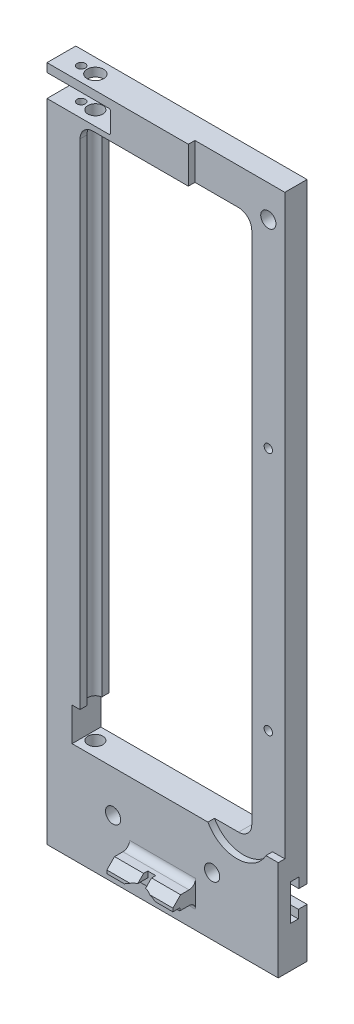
ISO-10303-21;
HEADER;
FILE_DESCRIPTION(('STEP AP214'),'2;1');
FILE_NAME('part.step','',(''),(''),'','','');
FILE_SCHEMA(('AUTOMOTIVE_DESIGN { 1 0 10303 214 1 1 1 1 }'));
ENDSEC;
DATA;
#1=APPLICATION_CONTEXT('core data for automotive mechanical design processes');
#2=APPLICATION_PROTOCOL_DEFINITION('international standard','automotive_design',2000,#1);
#3=PRODUCT_CONTEXT('',#1,'mechanical');
#4=PRODUCT('Part','Part','',(#3));
#5=PRODUCT_RELATED_PRODUCT_CATEGORY('part','',(#4));
#6=PRODUCT_DEFINITION_FORMATION('','',#4);
#7=PRODUCT_DEFINITION_CONTEXT('part definition',#1,'design');
#8=PRODUCT_DEFINITION('design','',#6,#7);
#9=PRODUCT_DEFINITION_SHAPE('','',#8);
#10=(LENGTH_UNIT() NAMED_UNIT(*) SI_UNIT(.MILLI.,.METRE.));
#11=(NAMED_UNIT(*) PLANE_ANGLE_UNIT() SI_UNIT($,.RADIAN.));
#12=(NAMED_UNIT(*) SI_UNIT($,.STERADIAN.) SOLID_ANGLE_UNIT());
#13=UNCERTAINTY_MEASURE_WITH_UNIT(LENGTH_MEASURE(1.E-05),#10,'distance_accuracy_value','');
#14=(GEOMETRIC_REPRESENTATION_CONTEXT(3) GLOBAL_UNCERTAINTY_ASSIGNED_CONTEXT((#13)) GLOBAL_UNIT_ASSIGNED_CONTEXT((#10,
#11,#12)) REPRESENTATION_CONTEXT('',''));
#15=CARTESIAN_POINT('',(0.,0.,0.));
#16=DIRECTION('',(0.,0.,1.));
#17=DIRECTION('',(1.,0.,0.));
#18=AXIS2_PLACEMENT_3D('',#15,#16,#17);
#19=CARTESIAN_POINT('',(6.35,5.88446561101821,7.1374));
#20=DIRECTION('',(0.,-0.707106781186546,-0.707106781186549));
#21=DIRECTION('',(0.,0.707106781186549,-0.707106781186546));
#22=AXIS2_PLACEMENT_3D('',#19,#20,#21);
#23=PLANE('',#22);
#24=DIRECTION('',(-1.,0.,0.));
#25=VECTOR('',#24,1.);
#26=CARTESIAN_POINT('',(6.35,5.88446561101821,7.1374));
#27=LINE('',#26,#25);
#28=CARTESIAN_POINT('',(-1.91513600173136,5.88446561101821,7.1374));
#29=VERTEX_POINT('',#28);
#30=CARTESIAN_POINT('',(-6.35,5.88446561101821,7.1374));
#31=VERTEX_POINT('',#30);
#32=EDGE_CURVE('E519',#29,#31,#27,.T.);
#33=ORIENTED_EDGE('',*,*,#32,.F.);
#34=CARTESIAN_POINT('',(0.,1.524,11.4978656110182));
#35=DIRECTION('',(0.,-0.707106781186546,-0.707106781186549));
#36=DIRECTION('',(0.,-0.707106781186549,0.707106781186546));
#37=AXIS2_PLACEMENT_3D('',#34,#35,#36);
#38=ELLIPSE('',#37,6.73519209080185,4.7625);
#39=CARTESIAN_POINT('',(-0.762,6.22514478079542,6.79672083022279));
#40=VERTEX_POINT('',#39);
#41=EDGE_CURVE('E438',#29,#40,#38,.T.);
#42=ORIENTED_EDGE('',*,*,#41,.T.);
#43=DIRECTION('',(0.,0.707106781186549,-0.707106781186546));
#44=VECTOR('',#43,1.);
#45=CARTESIAN_POINT('',(-0.762,5.88446561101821,7.1374));
#46=LINE('',#45,#44);
#47=CARTESIAN_POINT('',(-0.762,7.366,5.65586561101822));
#48=VERTEX_POINT('',#47);
#49=EDGE_CURVE('E467',#40,#48,#46,.T.);
#50=ORIENTED_EDGE('',*,*,#49,.T.);
#51=DIRECTION('',(-1.,0.,0.));
#52=VECTOR('',#51,1.);
#53=CARTESIAN_POINT('',(6.35,7.366,5.65586561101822));
#54=LINE('',#53,#52);
#55=CARTESIAN_POINT('',(-6.35,7.366,5.65586561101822));
#56=VERTEX_POINT('',#55);
#57=EDGE_CURVE('E523',#48,#56,#54,.T.);
#58=ORIENTED_EDGE('',*,*,#57,.T.);
#59=DIRECTION('',(0.,-0.707106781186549,0.707106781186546));
#60=VECTOR('',#59,1.);
#61=CARTESIAN_POINT('',(-6.35,5.88446561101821,7.1374));
#62=LINE('',#61,#60);
#63=EDGE_CURVE('E493',#56,#31,#62,.T.);
#64=ORIENTED_EDGE('',*,*,#63,.T.);
#65=EDGE_LOOP('',(#33,#42,#50,#58,#64));
#66=FACE_BOUND('',#65,.T.);
#67=ADVANCED_FACE('F37',(#66),#23,.F.);
#68=CARTESIAN_POINT('',(6.35,5.2578,7.1374));
#69=DIRECTION('',(0.,0.,-1.));
#70=DIRECTION('',(-1.,0.,0.));
#71=AXIS2_PLACEMENT_3D('',#68,#69,#70);
#72=PLANE('',#71);
#73=DIRECTION('',(-1.,0.,0.));
#74=VECTOR('',#73,1.);
#75=CARTESIAN_POINT('',(6.35,5.2578,7.1374));
#76=LINE('',#75,#74);
#77=CARTESIAN_POINT('',(-2.95637342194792,5.2578,7.1374));
#78=VERTEX_POINT('',#77);
#79=CARTESIAN_POINT('',(-6.35,5.2578,7.1374));
#80=VERTEX_POINT('',#79);
#81=EDGE_CURVE('E515',#78,#80,#76,.T.);
#82=ORIENTED_EDGE('',*,*,#81,.F.);
#83=CARTESIAN_POINT('',(0.,1.524,7.1374));
#84=DIRECTION('',(0.,0.,1.));
#85=DIRECTION('',(1.,0.,0.));
#86=AXIS2_PLACEMENT_3D('',#83,#84,#85);
#87=CIRCLE('',#86,4.7625);
#88=EDGE_CURVE('E955',#29,#78,#87,.T.);
#89=ORIENTED_EDGE('',*,*,#88,.F.);
#90=ORIENTED_EDGE('',*,*,#32,.T.);
#91=DIRECTION('',(0.,-1.,0.));
#92=VECTOR('',#91,1.);
#93=CARTESIAN_POINT('',(-6.35,5.2578,7.1374));
#94=LINE('',#93,#92);
#95=EDGE_CURVE('E496',#31,#80,#94,.T.);
#96=ORIENTED_EDGE('',*,*,#95,.T.);
#97=EDGE_LOOP('',(#82,#89,#90,#96));
#98=FACE_BOUND('',#97,.T.);
#99=ADVANCED_FACE('F924',(#98),#72,.F.);
#100=CARTESIAN_POINT('',(6.35,5.2578,7.1374));
#101=DIRECTION('',(0.,1.,0.));
#102=DIRECTION('',(0.,0.,1.));
#103=AXIS2_PLACEMENT_3D('',#100,#101,#102);
#104=PLANE('',#103);
#105=DIRECTION('',(-1.,0.,0.));
#106=VECTOR('',#105,1.);
#107=CARTESIAN_POINT('',(6.35,5.2578,5.8166));
#108=LINE('',#107,#106);
#109=CARTESIAN_POINT('',(-2.95637342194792,5.2578,5.8166));
#110=VERTEX_POINT('',#109);
#111=CARTESIAN_POINT('',(-6.35,5.2578,5.8166));
#112=VERTEX_POINT('',#111);
#113=EDGE_CURVE('E511',#110,#112,#108,.T.);
#114=ORIENTED_EDGE('',*,*,#113,.F.);
#115=DIRECTION('',(0.,0.,1.));
#116=VECTOR('',#115,1.);
#117=CARTESIAN_POINT('',(-2.95637342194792,5.2578,-8.61898418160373));
#118=LINE('',#117,#116);
#119=EDGE_CURVE('E448',#110,#78,#118,.T.);
#120=ORIENTED_EDGE('',*,*,#119,.T.);
#121=ORIENTED_EDGE('',*,*,#81,.T.);
#122=DIRECTION('',(0.,0.,-1.));
#123=VECTOR('',#122,1.);
#124=CARTESIAN_POINT('',(-6.35,5.2578,7.1374));
#125=LINE('',#124,#123);
#126=EDGE_CURVE('E499',#80,#112,#125,.T.);
#127=ORIENTED_EDGE('',*,*,#126,.T.);
#128=EDGE_LOOP('',(#114,#120,#121,#127));
#129=FACE_BOUND('',#128,.T.);
#130=ADVANCED_FACE('F919',(#129),#104,.F.);
#131=CARTESIAN_POINT('',(6.35,5.2578,5.8166));
#132=DIRECTION('',(0.,0.,-1.));
#133=DIRECTION('',(-1.,0.,0.));
#134=AXIS2_PLACEMENT_3D('',#131,#132,#133);
#135=PLANE('',#134);
#136=DIRECTION('',(-1.,0.,0.));
#137=VECTOR('',#136,1.);
#138=CARTESIAN_POINT('',(6.35,4.7498,5.8166));
#139=LINE('',#138,#137);
#140=CARTESIAN_POINT('',(-3.50365817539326,4.7498,5.8166));
#141=VERTEX_POINT('',#140);
#142=CARTESIAN_POINT('',(-6.35,4.7498,5.8166));
#143=VERTEX_POINT('',#142);
#144=EDGE_CURVE('E508',#141,#143,#139,.T.);
#145=ORIENTED_EDGE('',*,*,#144,.F.);
#146=CARTESIAN_POINT('',(0.,1.524,5.8166));
#147=DIRECTION('',(0.,0.,-1.));
#148=DIRECTION('',(-1.,0.,0.));
#149=AXIS2_PLACEMENT_3D('',#146,#147,#148);
#150=CIRCLE('',#149,4.7625);
#151=EDGE_CURVE('E417',#141,#110,#150,.T.);
#152=ORIENTED_EDGE('',*,*,#151,.T.);
#153=ORIENTED_EDGE('',*,*,#113,.T.);
#154=DIRECTION('',(0.,-1.,0.));
#155=VECTOR('',#154,1.);
#156=CARTESIAN_POINT('',(-6.35,5.2578,5.8166));
#157=LINE('',#156,#155);
#158=EDGE_CURVE('E502',#112,#143,#157,.T.);
#159=ORIENTED_EDGE('',*,*,#158,.T.);
#160=EDGE_LOOP('',(#145,#152,#153,#159));
#161=FACE_BOUND('',#160,.T.);
#162=ADVANCED_FACE('F914',(#161),#135,.F.);
#163=CARTESIAN_POINT('',(0.,0.,2.7686));
#164=DIRECTION('',(0.,0.,1.));
#165=DIRECTION('',(1.,0.,0.));
#166=AXIS2_PLACEMENT_3D('',#163,#164,#165);
#167=PLANE('',#166);
#168=CARTESIAN_POINT('',(0.,4.7498,2.7686));
#169=DIRECTION('',(0.,0.,1.));
#170=DIRECTION('',(1.,0.,0.));
#171=AXIS2_PLACEMENT_3D('',#168,#169,#170);
#172=CIRCLE('',#171,2.4003);
#173=CARTESIAN_POINT('',(2.03679652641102,3.4798,2.7686));
#174=VERTEX_POINT('',#173);
#175=CARTESIAN_POINT('',(-2.03679652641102,3.4798,2.7686));
#176=VERTEX_POINT('',#175);
#177=EDGE_CURVE('E410',#174,#176,#172,.F.);
#178=ORIENTED_EDGE('',*,*,#177,.T.);
#179=DIRECTION('',(-1.,0.,0.));
#180=VECTOR('',#179,1.);
#181=CARTESIAN_POINT('',(0.,3.4798,2.7686));
#182=LINE('',#181,#180);
#183=CARTESIAN_POINT('',(-6.35,3.4798,2.7686));
#184=VERTEX_POINT('',#183);
#185=EDGE_CURVE('E1223',#176,#184,#182,.T.);
#186=ORIENTED_EDGE('',*,*,#185,.T.);
#187=DIRECTION('',(0.,1.,0.));
#188=VECTOR('',#187,1.);
#189=CARTESIAN_POINT('',(-6.35,7.366,2.7686));
#190=LINE('',#189,#188);
#191=CARTESIAN_POINT('',(-6.35,8.636,2.7686));
#192=VERTEX_POINT('',#191);
#193=EDGE_CURVE('E472',#184,#192,#190,.T.);
#194=ORIENTED_EDGE('',*,*,#193,.T.);
#195=DIRECTION('',(-1.,0.,0.));
#196=VECTOR('',#195,1.);
#197=CARTESIAN_POINT('',(0.,8.636,2.7686));
#198=LINE('',#197,#196);
#199=CARTESIAN_POINT('',(6.35,8.636,2.7686));
#200=VERTEX_POINT('',#199);
#201=EDGE_CURVE('E1217',#192,#200,#198,.F.);
#202=ORIENTED_EDGE('',*,*,#201,.T.);
#203=DIRECTION('',(0.,1.,0.));
#204=VECTOR('',#203,1.);
#205=CARTESIAN_POINT('',(6.35,7.366,2.7686));
#206=LINE('',#205,#204);
#207=CARTESIAN_POINT('',(6.35,3.4798,2.7686));
#208=VERTEX_POINT('',#207);
#209=EDGE_CURVE('E473',#208,#200,#206,.T.);
#210=ORIENTED_EDGE('',*,*,#209,.F.);
#211=DIRECTION('',(-1.,0.,0.));
#212=VECTOR('',#211,1.);
#213=CARTESIAN_POINT('',(0.,3.4798,2.7686));
#214=LINE('',#213,#212);
#215=EDGE_CURVE('E1220',#208,#174,#214,.T.);
#216=ORIENTED_EDGE('',*,*,#215,.T.);
#217=EDGE_LOOP('',(#178,#186,#194,#202,#210,#216));
#218=FACE_BOUND('',#217,.T.);
#219=DIRECTION('',(-1.,0.,0.));
#220=VECTOR('',#219,1.);
#221=CARTESIAN_POINT('',(-22.225,128.524,2.7686));
#222=LINE('',#221,#220);
#223=CARTESIAN_POINT('',(-10.287,128.524,2.7686));
#224=VERTEX_POINT('',#223);
#225=CARTESIAN_POINT('',(-22.225,128.524,2.7686));
#226=VERTEX_POINT('',#225);
#227=EDGE_CURVE('E556',#224,#226,#222,.T.);
#228=ORIENTED_EDGE('',*,*,#227,.F.);
#229=CARTESIAN_POINT('',(-10.287,128.27,2.7686));
#230=DIRECTION('',(0.,0.,1.));
#231=DIRECTION('',(1.,0.,0.));
#232=AXIS2_PLACEMENT_3D('',#229,#230,#231);
#233=CIRCLE('',#232,0.254);
#234=CARTESIAN_POINT('',(-10.033,128.27,2.7686));
#235=VERTEX_POINT('',#234);
#236=EDGE_CURVE('E789',#224,#235,#233,.F.);
#237=ORIENTED_EDGE('',*,*,#236,.T.);
#238=DIRECTION('',(0.,1.,0.));
#239=VECTOR('',#238,1.);
#240=CARTESIAN_POINT('',(-10.033,128.524,2.7686));
#241=LINE('',#240,#239);
#242=CARTESIAN_POINT('',(-10.033,124.46,2.7686));
#243=VERTEX_POINT('',#242);
#244=EDGE_CURVE('E564',#243,#235,#241,.T.);
#245=ORIENTED_EDGE('',*,*,#244,.F.);
#246=CARTESIAN_POINT('',(-10.287,124.46,2.7686));
#247=DIRECTION('',(0.,0.,1.));
#248=DIRECTION('',(1.,0.,0.));
#249=AXIS2_PLACEMENT_3D('',#246,#247,#248);
#250=CIRCLE('',#249,0.254);
#251=CARTESIAN_POINT('',(-10.287,124.206,2.7686));
#252=VERTEX_POINT('',#251);
#253=EDGE_CURVE('E785',#243,#252,#250,.F.);
#254=ORIENTED_EDGE('',*,*,#253,.T.);
#255=DIRECTION('',(1.,0.,0.));
#256=VECTOR('',#255,1.);
#257=CARTESIAN_POINT('',(-22.225,124.206,2.7686));
#258=LINE('',#257,#256);
#259=CARTESIAN_POINT('',(-22.225,124.206,2.7686));
#260=VERTEX_POINT('',#259);
#261=EDGE_CURVE('E551',#260,#252,#258,.T.);
#262=ORIENTED_EDGE('',*,*,#261,.F.);
#263=DIRECTION('',(0.,-1.,0.));
#264=VECTOR('',#263,1.);
#265=CARTESIAN_POINT('',(-22.225,0.,2.7686));
#266=LINE('',#265,#264);
#267=CARTESIAN_POINT('',(-22.225,0.,2.7686));
#268=VERTEX_POINT('',#267);
#269=EDGE_CURVE('E701',#260,#268,#266,.T.);
#270=ORIENTED_EDGE('',*,*,#269,.T.);
#271=DIRECTION('',(1.,0.,0.));
#272=VECTOR('',#271,1.);
#273=CARTESIAN_POINT('',(0.,0.,2.7686));
#274=LINE('',#273,#272);
#275=CARTESIAN_POINT('',(22.225,0.,2.7686));
#276=VERTEX_POINT('',#275);
#277=EDGE_CURVE('E705',#268,#276,#274,.T.);
#278=ORIENTED_EDGE('',*,*,#277,.T.);
#279=DIRECTION('',(0.,-1.,0.));
#280=VECTOR('',#279,1.);
#281=CARTESIAN_POINT('',(22.225,0.,2.7686));
#282=LINE('',#281,#280);
#283=CARTESIAN_POINT('',(22.225,19.2024,2.7686));
#284=VERTEX_POINT('',#283);
#285=EDGE_CURVE('E696',#284,#276,#282,.T.);
#286=ORIENTED_EDGE('',*,*,#285,.F.);
#287=DIRECTION('',(-1.,0.,0.));
#288=VECTOR('',#287,1.);
#289=CARTESIAN_POINT('',(0.,19.2024,2.7686));
#290=LINE('',#289,#288);
#291=CARTESIAN_POINT('',(19.8664664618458,19.2024,2.7686));
#292=VERTEX_POINT('',#291);
#293=EDGE_CURVE('E713',#284,#292,#290,.T.);
#294=ORIENTED_EDGE('',*,*,#293,.T.);
#295=CARTESIAN_POINT('',(14.2875,22.23516,2.7686));
#296=DIRECTION('',(0.,0.,1.));
#297=DIRECTION('',(1.,0.,0.));
#298=AXIS2_PLACEMENT_3D('',#295,#296,#297);
#299=CIRCLE('',#298,6.35);
#300=CARTESIAN_POINT('',(8.70853353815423,19.2024,2.7686));
#301=VERTEX_POINT('',#300);
#302=EDGE_CURVE('E571',#301,#292,#299,.T.);
#303=ORIENTED_EDGE('',*,*,#302,.F.);
#304=CARTESIAN_POINT('',(-17.399,19.2024,2.7686));
#305=VERTEX_POINT('',#304);
#306=EDGE_CURVE('E712',#301,#305,#290,.T.);
#307=ORIENTED_EDGE('',*,*,#306,.T.);
#308=DIRECTION('',(0.,1.,0.));
#309=VECTOR('',#308,1.);
#310=CARTESIAN_POINT('',(-17.399,0.,2.7686));
#311=LINE('',#310,#309);
#312=CARTESIAN_POINT('',(-17.399,25.6386199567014,2.7686));
#313=VERTEX_POINT('',#312);
#314=EDGE_CURVE('E716',#305,#313,#311,.T.);
#315=ORIENTED_EDGE('',*,*,#314,.T.);
#316=DIRECTION('',(1.,0.,0.));
#317=VECTOR('',#316,1.);
#318=CARTESIAN_POINT('',(0.,25.6386199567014,2.7686));
#319=LINE('',#318,#317);
#320=CARTESIAN_POINT('',(-15.875,25.6386199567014,2.7686));
#321=VERTEX_POINT('',#320);
#322=EDGE_CURVE('E719',#313,#321,#319,.T.);
#323=ORIENTED_EDGE('',*,*,#322,.T.);
#324=DIRECTION('',(0.,-1.,0.));
#325=VECTOR('',#324,1.);
#326=CARTESIAN_POINT('',(-15.875,0.,2.7686));
#327=LINE('',#326,#325);
#328=CARTESIAN_POINT('',(-15.875,120.65,2.7686));
#329=VERTEX_POINT('',#328);
#330=EDGE_CURVE('E708',#329,#321,#327,.T.);
#331=ORIENTED_EDGE('',*,*,#330,.F.);
#332=CARTESIAN_POINT('',(-13.335,120.65,2.7686));
#333=DIRECTION('',(0.,0.,1.));
#334=DIRECTION('',(1.,0.,0.));
#335=AXIS2_PLACEMENT_3D('',#332,#333,#334);
#336=CIRCLE('',#335,2.54);
#337=CARTESIAN_POINT('',(-13.335,123.19,2.7686));
#338=VERTEX_POINT('',#337);
#339=EDGE_CURVE('E822',#329,#338,#336,.F.);
#340=ORIENTED_EDGE('',*,*,#339,.T.);
#341=DIRECTION('',(1.,0.,0.));
#342=VECTOR('',#341,1.);
#343=CARTESIAN_POINT('',(0.,123.19,2.7686));
#344=LINE('',#343,#342);
#345=CARTESIAN_POINT('',(4.95300000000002,123.19,2.7686));
#346=VERTEX_POINT('',#345);
#347=EDGE_CURVE('E710',#338,#346,#344,.T.);
#348=ORIENTED_EDGE('',*,*,#347,.T.);
#349=DIRECTION('',(0.,-1.,0.));
#350=VECTOR('',#349,1.);
#351=CARTESIAN_POINT('',(4.95300000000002,130.175,2.7686));
#352=LINE('',#351,#350);
#353=CARTESIAN_POINT('',(4.95300000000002,130.175,2.7686));
#354=VERTEX_POINT('',#353);
#355=EDGE_CURVE('E583',#354,#346,#352,.T.);
#356=ORIENTED_EDGE('',*,*,#355,.F.);
#357=DIRECTION('',(-1.,0.,0.));
#358=VECTOR('',#357,1.);
#359=CARTESIAN_POINT('',(0.,130.175,2.7686));
#360=LINE('',#359,#358);
#361=CARTESIAN_POINT('',(-22.225,130.175,2.7686));
#362=VERTEX_POINT('',#361);
#363=EDGE_CURVE('E698',#354,#362,#360,.T.);
#364=ORIENTED_EDGE('',*,*,#363,.T.);
#365=EDGE_CURVE('E702',#362,#226,#266,.T.);
#366=ORIENTED_EDGE('',*,*,#365,.T.);
#367=EDGE_LOOP('',(#228,#237,#245,#254,#262,#270,#278,#286,#294,#303,#307,#315,#323,#331,#340,
#348,#356,#364,#366));
#368=FACE_BOUND('',#367,.T.);
#369=CARTESIAN_POINT('',(-9.52500000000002,11.2014,2.7686));
#370=DIRECTION('',(0.,0.,1.));
#371=DIRECTION('',(1.,0.,0.));
#372=AXIS2_PLACEMENT_3D('',#369,#370,#371);
#373=CIRCLE('',#372,1.4605);
#374=CARTESIAN_POINT('',(-8.06450000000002,11.2014,2.7686));
#375=VERTEX_POINT('',#374);
#376=EDGE_CURVE('E618',#375,#375,#373,.T.);
#377=ORIENTED_EDGE('',*,*,#376,.F.);
#378=EDGE_LOOP('',(#377));
#379=FACE_BOUND('',#378,.T.);
#380=CARTESIAN_POINT('',(9.52499999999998,11.2014,2.7686));
#381=DIRECTION('',(0.,0.,1.));
#382=DIRECTION('',(1.,0.,0.));
#383=AXIS2_PLACEMENT_3D('',#380,#381,#382);
#384=CIRCLE('',#383,1.4605);
#385=CARTESIAN_POINT('',(10.9855,11.2014,2.7686));
#386=VERTEX_POINT('',#385);
#387=EDGE_CURVE('E626',#386,#386,#384,.T.);
#388=ORIENTED_EDGE('',*,*,#387,.F.);
#389=EDGE_LOOP('',(#388));
#390=FACE_BOUND('',#389,.T.);
#391=ADVANCED_FACE('F1046',(#218,#368,#379,#390),#167,.T.);
#392=CARTESIAN_POINT('',(-15.875,0.,2.7686));
#393=DIRECTION('',(1.,0.,0.));
#394=DIRECTION('',(0.,1.,0.));
#395=AXIS2_PLACEMENT_3D('',#392,#393,#394);
#396=PLANE('',#395);
#397=DIRECTION('',(0.,-1.,0.));
#398=VECTOR('',#397,1.);
#399=CARTESIAN_POINT('',(-15.875,0.,-2.7686));
#400=LINE('',#399,#398);
#401=CARTESIAN_POINT('',(-15.875,120.65,-2.7686));
#402=VERTEX_POINT('',#401);
#403=CARTESIAN_POINT('',(-15.875,25.6386199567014,-2.7686));
#404=VERTEX_POINT('',#403);
#405=EDGE_CURVE('E736',#402,#404,#400,.T.);
#406=ORIENTED_EDGE('',*,*,#405,.F.);
#407=DIRECTION('',(0.,0.,-1.));
#408=VECTOR('',#407,1.);
#409=CARTESIAN_POINT('',(-15.875,120.65,2.7686));
#410=LINE('',#409,#408);
#411=CARTESIAN_POINT('',(-15.875,120.65,-1.42404324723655));
#412=VERTEX_POINT('',#411);
#413=EDGE_CURVE('E800',#402,#412,#410,.F.);
#414=ORIENTED_EDGE('',*,*,#413,.T.);
#415=DIRECTION('',(0.,1.,0.));
#416=VECTOR('',#415,1.);
#417=CARTESIAN_POINT('',(-15.875,10.7745242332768,-1.42404324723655));
#418=LINE('',#417,#416);
#419=CARTESIAN_POINT('',(-15.875,25.6386199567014,-1.42404324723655));
#420=VERTEX_POINT('',#419);
#421=EDGE_CURVE('E537',#420,#412,#418,.T.);
#422=ORIENTED_EDGE('',*,*,#421,.F.);
#423=DIRECTION('',(0.,0.,-1.));
#424=VECTOR('',#423,1.);
#425=CARTESIAN_POINT('',(-15.875,25.6386199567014,2.7686));
#426=LINE('',#425,#424);
#427=EDGE_CURVE('E755',#420,#404,#426,.T.);
#428=ORIENTED_EDGE('',*,*,#427,.T.);
#429=EDGE_LOOP('',(#406,#414,#422,#428));
#430=FACE_BOUND('',#429,.T.);
#431=ADVANCED_FACE('F1049',(#430),#396,.T.);
#432=CARTESIAN_POINT('',(-22.225,14.8336,0.4064));
#433=DIRECTION('',(0.,1.,0.));
#434=DIRECTION('',(0.,0.,1.));
#435=AXIS2_PLACEMENT_3D('',#432,#433,#434);
#436=PLANE('',#435);
#437=DIRECTION('',(1.,0.,0.));
#438=VECTOR('',#437,1.);
#439=CARTESIAN_POINT('',(-22.225,14.8336,0.4064));
#440=LINE('',#439,#438);
#441=CARTESIAN_POINT('',(-14.3208457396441,14.8336,0.4064));
#442=VERTEX_POINT('',#441);
#443=CARTESIAN_POINT('',(22.225,14.8336,0.4064));
#444=VERTEX_POINT('',#443);
#445=EDGE_CURVE('E687',#442,#444,#440,.T.);
#446=ORIENTED_EDGE('',*,*,#445,.F.);
#447=CARTESIAN_POINT('',(-15.6972,14.8336,0.));
#448=DIRECTION('',(0.,1.,0.));
#449=DIRECTION('',(0.,0.,1.));
#450=AXIS2_PLACEMENT_3D('',#447,#448,#449);
#451=CIRCLE('',#450,1.4351);
#452=CARTESIAN_POINT('',(-14.8820222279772,14.8336,-1.1811));
#453=VERTEX_POINT('',#452);
#454=EDGE_CURVE('E1088',#453,#442,#451,.F.);
#455=ORIENTED_EDGE('',*,*,#454,.F.);
#456=DIRECTION('',(1.,0.,0.));
#457=VECTOR('',#456,1.);
#458=CARTESIAN_POINT('',(-22.225,14.8336,-1.1811));
#459=LINE('',#458,#457);
#460=CARTESIAN_POINT('',(22.225,14.8336,-1.1811));
#461=VERTEX_POINT('',#460);
#462=EDGE_CURVE('E692',#453,#461,#459,.T.);
#463=ORIENTED_EDGE('',*,*,#462,.T.);
#464=DIRECTION('',(0.,0.,1.));
#465=VECTOR('',#464,1.);
#466=CARTESIAN_POINT('',(22.225,14.8336,0.4064));
#467=LINE('',#466,#465);
#468=EDGE_CURVE('E638',#461,#444,#467,.T.);
#469=ORIENTED_EDGE('',*,*,#468,.T.);
#470=EDGE_LOOP('',(#446,#455,#463,#469));
#471=FACE_BOUND('',#470,.T.);
#472=ADVANCED_FACE('F1092',(#471),#436,.F.);
#473=CARTESIAN_POINT('',(-22.225,0.,2.7686));
#474=DIRECTION('',(1.,0.,0.));
#475=DIRECTION('',(0.,1.,0.));
#476=AXIS2_PLACEMENT_3D('',#473,#474,#475);
#477=PLANE('',#476);
#478=DIRECTION('',(0.,-1.,0.));
#479=VECTOR('',#478,1.);
#480=CARTESIAN_POINT('',(-22.225,0.,-2.7686));
#481=LINE('',#480,#479);
#482=CARTESIAN_POINT('',(-22.225,130.175,-2.7686));
#483=VERTEX_POINT('',#482);
#484=CARTESIAN_POINT('',(-22.225,128.524,-2.7686));
#485=VERTEX_POINT('',#484);
#486=EDGE_CURVE('E729',#483,#485,#481,.T.);
#487=ORIENTED_EDGE('',*,*,#486,.T.);
#488=DIRECTION('',(0.,0.,1.));
#489=VECTOR('',#488,1.);
#490=CARTESIAN_POINT('',(-22.225,128.524,-2.7686));
#491=LINE('',#490,#489);
#492=EDGE_CURVE('E568',#485,#226,#491,.T.);
#493=ORIENTED_EDGE('',*,*,#492,.T.);
#494=ORIENTED_EDGE('',*,*,#365,.F.);
#495=DIRECTION('',(0.,0.,-1.));
#496=VECTOR('',#495,1.);
#497=CARTESIAN_POINT('',(-22.225,130.175,2.7686));
#498=LINE('',#497,#496);
#499=EDGE_CURVE('E767',#362,#483,#498,.T.);
#500=ORIENTED_EDGE('',*,*,#499,.T.);
#501=EDGE_LOOP('',(#487,#493,#494,#500));
#502=FACE_BOUND('',#501,.T.);
#503=ADVANCED_FACE('F1013',(#502),#477,.F.);
#504=CARTESIAN_POINT('',(0.,19.2024,2.7686));
#505=DIRECTION('',(0.,-1.,0.));
#506=DIRECTION('',(0.,0.,-1.));
#507=AXIS2_PLACEMENT_3D('',#504,#505,#506);
#508=PLANE('',#507);
#509=DIRECTION('',(1.,0.,0.));
#510=VECTOR('',#509,1.);
#511=CARTESIAN_POINT('',(4.95300000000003,19.2024,1.4986));
#512=LINE('',#511,#510);
#513=CARTESIAN_POINT('',(19.8664664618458,19.2024,1.4986));
#514=VERTEX_POINT('',#513);
#515=CARTESIAN_POINT('',(22.225,19.2024,1.4986));
#516=VERTEX_POINT('',#515);
#517=EDGE_CURVE('E587',#514,#516,#512,.T.);
#518=ORIENTED_EDGE('',*,*,#517,.F.);
#519=DIRECTION('',(0.,0.,1.));
#520=VECTOR('',#519,1.);
#521=CARTESIAN_POINT('',(19.8664664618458,19.2024,-16.4619122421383));
#522=LINE('',#521,#520);
#523=EDGE_CURVE('E580',#514,#292,#522,.T.);
#524=ORIENTED_EDGE('',*,*,#523,.T.);
#525=ORIENTED_EDGE('',*,*,#293,.F.);
#526=DIRECTION('',(0.,0.,1.));
#527=VECTOR('',#526,1.);
#528=CARTESIAN_POINT('',(22.225,19.2024,1.4986));
#529=LINE('',#528,#527);
#530=EDGE_CURVE('E594',#516,#284,#529,.T.);
#531=ORIENTED_EDGE('',*,*,#530,.F.);
#532=EDGE_LOOP('',(#518,#524,#525,#531));
#533=FACE_BOUND('',#532,.T.);
#534=ADVANCED_FACE('F1133',(#533),#508,.F.);
#535=CARTESIAN_POINT('',(15.875,0.,2.7686));
#536=DIRECTION('',(1.,0.,0.));
#537=DIRECTION('',(0.,1.,0.));
#538=AXIS2_PLACEMENT_3D('',#535,#536,#537);
#539=PLANE('',#538);
#540=DIRECTION('',(0.,-1.,0.));
#541=VECTOR('',#540,1.);
#542=CARTESIAN_POINT('',(15.875,0.,1.4986));
#543=LINE('',#542,#541);
#544=CARTESIAN_POINT('',(15.875,120.65,1.4986));
#545=VERTEX_POINT('',#544);
#546=CARTESIAN_POINT('',(15.875,21.7424,1.4986));
#547=VERTEX_POINT('',#546);
#548=EDGE_CURVE('E608',#545,#547,#543,.T.);
#549=ORIENTED_EDGE('',*,*,#548,.F.);
#550=DIRECTION('',(0.,0.,-1.));
#551=VECTOR('',#550,1.);
#552=CARTESIAN_POINT('',(15.875,120.65,-2.7686));
#553=LINE('',#552,#551);
#554=CARTESIAN_POINT('',(15.875,120.65,-2.7686));
#555=VERTEX_POINT('',#554);
#556=EDGE_CURVE('E806',#545,#555,#553,.T.);
#557=ORIENTED_EDGE('',*,*,#556,.T.);
#558=DIRECTION('',(0.,-1.,0.));
#559=VECTOR('',#558,1.);
#560=CARTESIAN_POINT('',(15.875,0.,-2.7686));
#561=LINE('',#560,#559);
#562=CARTESIAN_POINT('',(15.875,21.7424,-2.7686));
#563=VERTEX_POINT('',#562);
#564=EDGE_CURVE('E741',#555,#563,#561,.T.);
#565=ORIENTED_EDGE('',*,*,#564,.T.);
#566=DIRECTION('',(0.,0.,-1.));
#567=VECTOR('',#566,1.);
#568=CARTESIAN_POINT('',(15.875,21.7424,1.4986));
#569=LINE('',#568,#567);
#570=EDGE_CURVE('E804',#563,#547,#569,.F.);
#571=ORIENTED_EDGE('',*,*,#570,.T.);
#572=EDGE_LOOP('',(#549,#557,#565,#571));
#573=FACE_BOUND('',#572,.T.);
#574=ADVANCED_FACE('F1134',(#573),#539,.F.);
#575=CARTESIAN_POINT('',(19.05,124.0536,-2.7696));
#576=DIRECTION('',(0.,0.,1.));
#577=DIRECTION('',(1.,0.,0.));
#578=AXIS2_PLACEMENT_3D('',#575,#576,#577);
#579=CYLINDRICAL_SURFACE('',#578,1.4605);
#580=CARTESIAN_POINT('',(19.05,124.0536,-2.7686));
#581=DIRECTION('',(0.,0.,1.));
#582=DIRECTION('',(1.,0.,0.));
#583=AXIS2_PLACEMENT_3D('',#580,#581,#582);
#584=CIRCLE('',#583,1.4605);
#585=CARTESIAN_POINT('',(20.5105,124.0536,-2.7686));
#586=VERTEX_POINT('',#585);
#587=EDGE_CURVE('E617',#586,#586,#584,.F.);
#588=CARTESIAN_POINT('',(19.05,124.0536,1.4986));
#589=DIRECTION('',(0.,0.,1.));
#590=DIRECTION('',(1.,0.,0.));
#591=AXIS2_PLACEMENT_3D('',#588,#589,#590);
#592=CIRCLE('',#591,1.4605);
#593=CARTESIAN_POINT('',(20.5105,124.0536,1.4986));
#594=VERTEX_POINT('',#593);
#595=EDGE_CURVE('E605',#594,#594,#592,.F.);
#596=CARTESIAN_POINT('',(20.5105,124.0536,-2.7686));
#597=CARTESIAN_POINT('',(20.5105,124.0536,-2.72415));
#598=CARTESIAN_POINT('',(20.5105,124.0536,-2.6797));
#599=CARTESIAN_POINT('',(20.5105,124.0536,-2.5908));
#600=CARTESIAN_POINT('',(20.5105,124.0536,-2.54635));
#601=CARTESIAN_POINT('',(20.5105,124.0536,-2.45745));
#602=CARTESIAN_POINT('',(20.5105,124.0536,-2.413));
#603=CARTESIAN_POINT('',(20.5105,124.0536,-2.3241));
#604=CARTESIAN_POINT('',(20.5105,124.0536,-2.27965));
#605=CARTESIAN_POINT('',(20.5105,124.0536,-2.19075));
#606=CARTESIAN_POINT('',(20.5105,124.0536,-2.1463));
#607=CARTESIAN_POINT('',(20.5105,124.0536,-2.0574));
#608=CARTESIAN_POINT('',(20.5105,124.0536,-2.01295));
#609=CARTESIAN_POINT('',(20.5105,124.0536,-1.92405));
#610=CARTESIAN_POINT('',(20.5105,124.0536,-1.8796));
#611=CARTESIAN_POINT('',(20.5105,124.0536,-1.7907));
#612=CARTESIAN_POINT('',(20.5105,124.0536,-1.74625));
#613=CARTESIAN_POINT('',(20.5105,124.0536,-1.65735));
#614=CARTESIAN_POINT('',(20.5105,124.0536,-1.6129));
#615=CARTESIAN_POINT('',(20.5105,124.0536,-1.524));
#616=CARTESIAN_POINT('',(20.5105,124.0536,-1.47955));
#617=CARTESIAN_POINT('',(20.5105,124.0536,-1.39065));
#618=CARTESIAN_POINT('',(20.5105,124.0536,-1.3462));
#619=CARTESIAN_POINT('',(20.5105,124.0536,-1.2573));
#620=CARTESIAN_POINT('',(20.5105,124.0536,-1.21285));
#621=CARTESIAN_POINT('',(20.5105,124.0536,-1.12395));
#622=CARTESIAN_POINT('',(20.5105,124.0536,-1.0795));
#623=CARTESIAN_POINT('',(20.5105,124.0536,-0.990600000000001));
#624=CARTESIAN_POINT('',(20.5105,124.0536,-0.94615));
#625=CARTESIAN_POINT('',(20.5105,124.0536,-0.857250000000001));
#626=CARTESIAN_POINT('',(20.5105,124.0536,-0.812800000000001));
#627=CARTESIAN_POINT('',(20.5105,124.0536,-0.723900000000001));
#628=CARTESIAN_POINT('',(20.5105,124.0536,-0.679450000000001));
#629=CARTESIAN_POINT('',(20.5105,124.0536,-0.590550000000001));
#630=CARTESIAN_POINT('',(20.5105,124.0536,-0.546100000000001));
#631=CARTESIAN_POINT('',(20.5105,124.0536,-0.457200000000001));
#632=CARTESIAN_POINT('',(20.5105,124.0536,-0.412750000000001));
#633=CARTESIAN_POINT('',(20.5105,124.0536,-0.323850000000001));
#634=CARTESIAN_POINT('',(20.5105,124.0536,-0.279400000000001));
#635=CARTESIAN_POINT('',(20.5105,124.0536,-0.190500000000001));
#636=CARTESIAN_POINT('',(20.5105,124.0536,-0.146050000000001));
#637=CARTESIAN_POINT('',(20.5105,124.0536,-0.0571500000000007));
#638=CARTESIAN_POINT('',(20.5105,124.0536,-0.0127000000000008));
#639=CARTESIAN_POINT('',(20.5105,124.0536,0.0761999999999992));
#640=CARTESIAN_POINT('',(20.5105,124.0536,0.120649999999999));
#641=CARTESIAN_POINT('',(20.5105,124.0536,0.209549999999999));
#642=CARTESIAN_POINT('',(20.5105,124.0536,0.253999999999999));
#643=CARTESIAN_POINT('',(20.5105,124.0536,0.342899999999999));
#644=CARTESIAN_POINT('',(20.5105,124.0536,0.387349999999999));
#645=CARTESIAN_POINT('',(20.5105,124.0536,0.47625));
#646=CARTESIAN_POINT('',(20.5105,124.0536,0.520699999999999));
#647=CARTESIAN_POINT('',(20.5105,124.0536,0.609599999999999));
#648=CARTESIAN_POINT('',(20.5105,124.0536,0.654049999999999));
#649=CARTESIAN_POINT('',(20.5105,124.0536,0.742949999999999));
#650=CARTESIAN_POINT('',(20.5105,124.0536,0.787399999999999));
#651=CARTESIAN_POINT('',(20.5105,124.0536,0.876299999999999));
#652=CARTESIAN_POINT('',(20.5105,124.0536,0.920749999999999));
#653=CARTESIAN_POINT('',(20.5105,124.0536,1.00965));
#654=CARTESIAN_POINT('',(20.5105,124.0536,1.0541));
#655=CARTESIAN_POINT('',(20.5105,124.0536,1.143));
#656=CARTESIAN_POINT('',(20.5105,124.0536,1.18745));
#657=CARTESIAN_POINT('',(20.5105,124.0536,1.27635));
#658=CARTESIAN_POINT('',(20.5105,124.0536,1.3208));
#659=CARTESIAN_POINT('',(20.5105,124.0536,1.4097));
#660=CARTESIAN_POINT('',(20.5105,124.0536,1.45415));
#661=CARTESIAN_POINT('',(20.5105,124.0536,1.4986));
#662=B_SPLINE_CURVE_WITH_KNOTS('',3,(#596,#597,#598,#599,#600,#601,#602,#603,#604,#605,#606,
#607,#608,#609,#610,#611,#612,#613,#614,#615,#616,#617,#618,#619,#620,#621,#622,#623,#624,#625,
#626,#627,#628,#629,#630,#631,#632,#633,#634,#635,#636,#637,#638,#639,#640,#641,#642,#643,#644,
#645,#646,#647,#648,#649,#650,#651,#652,#653,#654,#655,#656,#657,#658,#659,#660,#661),
.UNSPECIFIED.,.F.,.F.,(4,2,2,2,2,2,2,2,2,2,2,2,2,2,2,2,2,2,2,2,2,2,2,2,2,2,2,2,2,2,2,2,4),(0.,
0.13335,0.266699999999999,0.40005,0.533399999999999,0.666749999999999,0.8001,0.93345,1.0668,
1.20015,1.3335,1.46685,1.6002,1.73355,1.8669,2.00025,2.1336,2.26695,2.4003,2.53365,2.667,
2.80035,2.9337,3.06705,3.2004,3.33375,3.4671,3.60045,3.7338,3.86715,4.0005,4.13385,4.2672),.UNSPECIFIED.);
#663=EDGE_CURVE('BSEAM1111',#586,#594,#662,.T.);
#664=ORIENTED_EDGE('',*,*,#587,.T.);
#665=ORIENTED_EDGE('',*,*,#595,.F.);
#666=ORIENTED_EDGE('',*,*,#663,.T.);
#667=ORIENTED_EDGE('',*,*,#663,.F.);
#668=EDGE_LOOP('',(#664,#666,#665,#667));
#669=FACE_BOUND('',#668,.T.);
#670=ADVANCED_FACE('F1111',(#669),#579,.F.);
#671=CARTESIAN_POINT('',(19.05,85.9536,-2.7696));
#672=DIRECTION('',(0.,0.,1.));
#673=DIRECTION('',(1.,0.,0.));
#674=AXIS2_PLACEMENT_3D('',#671,#672,#673);
#675=CYLINDRICAL_SURFACE('',#674,0.8001);
#676=CARTESIAN_POINT('',(19.05,85.9536,-2.04310081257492));
#677=DIRECTION('',(0.,0.,1.));
#678=DIRECTION('',(1.,0.,0.));
#679=AXIS2_PLACEMENT_3D('',#676,#677,#678);
#680=CIRCLE('',#679,0.8001);
#681=CARTESIAN_POINT('',(19.8501,85.9536,-2.04310081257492));
#682=VERTEX_POINT('',#681);
#683=EDGE_CURVE('E1214',#682,#682,#680,.F.);
#684=CARTESIAN_POINT('',(19.05,85.9536,1.4986));
#685=DIRECTION('',(0.,0.,1.));
#686=DIRECTION('',(1.,0.,0.));
#687=AXIS2_PLACEMENT_3D('',#684,#685,#686);
#688=CIRCLE('',#687,0.8001);
#689=CARTESIAN_POINT('',(19.8501,85.9536,1.4986));
#690=VERTEX_POINT('',#689);
#691=EDGE_CURVE('E602',#690,#690,#688,.F.);
#692=CARTESIAN_POINT('',(19.8501,85.9536,-2.04310081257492));
#693=CARTESIAN_POINT('',(19.8501,85.9536,-2.00620809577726));
#694=CARTESIAN_POINT('',(19.8501,85.9536,-1.96931537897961));
#695=CARTESIAN_POINT('',(19.8501,85.9536,-1.8955299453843));
#696=CARTESIAN_POINT('',(19.8501,85.9536,-1.85863722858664));
#697=CARTESIAN_POINT('',(19.8501,85.9536,-1.78485179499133));
#698=CARTESIAN_POINT('',(19.8501,85.9536,-1.74795907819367));
#699=CARTESIAN_POINT('',(19.8501,85.9536,-1.67417364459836));
#700=CARTESIAN_POINT('',(19.8501,85.9536,-1.63728092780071));
#701=CARTESIAN_POINT('',(19.8501,85.9536,-1.5634954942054));
#702=CARTESIAN_POINT('',(19.8501,85.9536,-1.52660277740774));
#703=CARTESIAN_POINT('',(19.8501,85.9536,-1.45281734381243));
#704=CARTESIAN_POINT('',(19.8501,85.9536,-1.41592462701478));
#705=CARTESIAN_POINT('',(19.8501,85.9536,-1.34213919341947));
#706=CARTESIAN_POINT('',(19.8501,85.9536,-1.30524647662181));
#707=CARTESIAN_POINT('',(19.8501,85.9536,-1.2314610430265));
#708=CARTESIAN_POINT('',(19.8501,85.9536,-1.19456832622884));
#709=CARTESIAN_POINT('',(19.8501,85.9536,-1.12078289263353));
#710=CARTESIAN_POINT('',(19.8501,85.9536,-1.08389017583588));
#711=CARTESIAN_POINT('',(19.8501,85.9536,-1.01010474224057));
#712=CARTESIAN_POINT('',(19.8501,85.9536,-0.973212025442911));
#713=CARTESIAN_POINT('',(19.8501,85.9536,-0.8994265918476));
#714=CARTESIAN_POINT('',(19.8501,85.9536,-0.862533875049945));
#715=CARTESIAN_POINT('',(19.8501,85.9536,-0.788748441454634));
#716=CARTESIAN_POINT('',(19.8501,85.9536,-0.751855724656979));
#717=CARTESIAN_POINT('',(19.8501,85.9536,-0.678070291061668));
#718=CARTESIAN_POINT('',(19.8501,85.9536,-0.641177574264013));
#719=CARTESIAN_POINT('',(19.8501,85.9536,-0.567392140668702));
#720=CARTESIAN_POINT('',(19.8501,85.9536,-0.530499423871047));
#721=CARTESIAN_POINT('',(19.8501,85.9536,-0.456713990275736));
#722=CARTESIAN_POINT('',(19.8501,85.9536,-0.419821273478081));
#723=CARTESIAN_POINT('',(19.8501,85.9536,-0.34603583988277));
#724=CARTESIAN_POINT('',(19.8501,85.9536,-0.309143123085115));
#725=CARTESIAN_POINT('',(19.8501,85.9536,-0.235357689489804));
#726=CARTESIAN_POINT('',(19.8501,85.9536,-0.198464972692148));
#727=CARTESIAN_POINT('',(19.8501,85.9536,-0.124679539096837));
#728=CARTESIAN_POINT('',(19.8501,85.9536,-0.0877868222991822));
#729=CARTESIAN_POINT('',(19.8501,85.9536,-0.0140013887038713));
#730=CARTESIAN_POINT('',(19.8501,85.9536,0.0228913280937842));
#731=CARTESIAN_POINT('',(19.8501,85.9536,0.096676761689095));
#732=CARTESIAN_POINT('',(19.8501,85.9536,0.13356947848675));
#733=CARTESIAN_POINT('',(19.8501,85.9536,0.207354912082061));
#734=CARTESIAN_POINT('',(19.8501,85.9536,0.244247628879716));
#735=CARTESIAN_POINT('',(19.8501,85.9536,0.318033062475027));
#736=CARTESIAN_POINT('',(19.8501,85.9536,0.354925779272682));
#737=CARTESIAN_POINT('',(19.8501,85.9536,0.428711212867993));
#738=CARTESIAN_POINT('',(19.8501,85.9536,0.465603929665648));
#739=CARTESIAN_POINT('',(19.8501,85.9536,0.539389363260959));
#740=CARTESIAN_POINT('',(19.8501,85.9536,0.576282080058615));
#741=CARTESIAN_POINT('',(19.8501,85.9536,0.650067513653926));
#742=CARTESIAN_POINT('',(19.8501,85.9536,0.686960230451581));
#743=CARTESIAN_POINT('',(19.8501,85.9536,0.760745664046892));
#744=CARTESIAN_POINT('',(19.8501,85.9536,0.797638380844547));
#745=CARTESIAN_POINT('',(19.8501,85.9536,0.871423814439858));
#746=CARTESIAN_POINT('',(19.8501,85.9536,0.908316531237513));
#747=CARTESIAN_POINT('',(19.8501,85.9536,0.982101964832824));
#748=CARTESIAN_POINT('',(19.8501,85.9536,1.01899468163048));
#749=CARTESIAN_POINT('',(19.8501,85.9536,1.09278011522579));
#750=CARTESIAN_POINT('',(19.8501,85.9536,1.12967283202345));
#751=CARTESIAN_POINT('',(19.8501,85.9536,1.20345826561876));
#752=CARTESIAN_POINT('',(19.8501,85.9536,1.24035098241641));
#753=CARTESIAN_POINT('',(19.8501,85.9536,1.31413641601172));
#754=CARTESIAN_POINT('',(19.8501,85.9536,1.35102913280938));
#755=CARTESIAN_POINT('',(19.8501,85.9536,1.42481456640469));
#756=CARTESIAN_POINT('',(19.8501,85.9536,1.46170728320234));
#757=CARTESIAN_POINT('',(19.8501,85.9536,1.4986));
#758=B_SPLINE_CURVE_WITH_KNOTS('',3,(#692,#693,#694,#695,#696,#697,#698,#699,#700,#701,#702,
#703,#704,#705,#706,#707,#708,#709,#710,#711,#712,#713,#714,#715,#716,#717,#718,#719,#720,#721,
#722,#723,#724,#725,#726,#727,#728,#729,#730,#731,#732,#733,#734,#735,#736,#737,#738,#739,#740,
#741,#742,#743,#744,#745,#746,#747,#748,#749,#750,#751,#752,#753,#754,#755,#756,#757),
.UNSPECIFIED.,.F.,.F.,(4,2,2,2,2,2,2,2,2,2,2,2,2,2,2,2,2,2,2,2,2,2,2,2,2,2,2,2,2,2,2,2,4),(0.,
0.110678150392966,0.221356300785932,0.332034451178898,0.442712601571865,0.553390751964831,
0.664068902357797,0.774747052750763,0.885425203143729,0.996103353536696,1.10678150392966,
1.21745965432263,1.32813780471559,1.43881595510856,1.54949410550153,1.66017225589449,
1.77085040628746,1.88152855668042,1.99220670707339,2.10288485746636,2.21356300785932,
2.32424115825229,2.43491930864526,2.54559745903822,2.65627560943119,2.76695375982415,
2.87763191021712,2.98831006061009,3.09898821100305,3.20966636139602,3.32034451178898,
3.43102266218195,3.54170081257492),.UNSPECIFIED.);
#759=EDGE_CURVE('BSEAM1184',#682,#690,#758,.T.);
#760=ORIENTED_EDGE('',*,*,#683,.T.);
#761=ORIENTED_EDGE('',*,*,#691,.F.);
#762=ORIENTED_EDGE('',*,*,#759,.T.);
#763=ORIENTED_EDGE('',*,*,#759,.F.);
#764=EDGE_LOOP('',(#760,#762,#761,#763));
#765=FACE_BOUND('',#764,.T.);
#766=ADVANCED_FACE('F1184',(#765),#675,.F.);
#767=CARTESIAN_POINT('',(19.05,38.9636,-2.7696));
#768=DIRECTION('',(0.,0.,1.));
#769=DIRECTION('',(1.,0.,0.));
#770=AXIS2_PLACEMENT_3D('',#767,#768,#769);
#771=CYLINDRICAL_SURFACE('',#770,0.8001);
#772=CARTESIAN_POINT('',(19.05,38.9636,-2.04310081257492));
#773=DIRECTION('',(0.,0.,1.));
#774=DIRECTION('',(1.,0.,0.));
#775=AXIS2_PLACEMENT_3D('',#772,#773,#774);
#776=CIRCLE('',#775,0.8001);
#777=CARTESIAN_POINT('',(19.8501,38.9636,-2.04310081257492));
#778=VERTEX_POINT('',#777);
#779=EDGE_CURVE('E1198',#778,#778,#776,.F.);
#780=CARTESIAN_POINT('',(19.05,38.9636,1.4986));
#781=DIRECTION('',(0.,0.,1.));
#782=DIRECTION('',(1.,0.,0.));
#783=AXIS2_PLACEMENT_3D('',#780,#781,#782);
#784=CIRCLE('',#783,0.8001);
#785=CARTESIAN_POINT('',(19.8501,38.9636,1.4986));
#786=VERTEX_POINT('',#785);
#787=EDGE_CURVE('E599',#786,#786,#784,.F.);
#788=CARTESIAN_POINT('',(19.8501,38.9636,-2.04310081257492));
#789=CARTESIAN_POINT('',(19.8501,38.9636,-2.00620809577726));
#790=CARTESIAN_POINT('',(19.8501,38.9636,-1.96931537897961));
#791=CARTESIAN_POINT('',(19.8501,38.9636,-1.8955299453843));
#792=CARTESIAN_POINT('',(19.8501,38.9636,-1.85863722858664));
#793=CARTESIAN_POINT('',(19.8501,38.9636,-1.78485179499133));
#794=CARTESIAN_POINT('',(19.8501,38.9636,-1.74795907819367));
#795=CARTESIAN_POINT('',(19.8501,38.9636,-1.67417364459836));
#796=CARTESIAN_POINT('',(19.8501,38.9636,-1.63728092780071));
#797=CARTESIAN_POINT('',(19.8501,38.9636,-1.5634954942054));
#798=CARTESIAN_POINT('',(19.8501,38.9636,-1.52660277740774));
#799=CARTESIAN_POINT('',(19.8501,38.9636,-1.45281734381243));
#800=CARTESIAN_POINT('',(19.8501,38.9636,-1.41592462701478));
#801=CARTESIAN_POINT('',(19.8501,38.9636,-1.34213919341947));
#802=CARTESIAN_POINT('',(19.8501,38.9636,-1.30524647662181));
#803=CARTESIAN_POINT('',(19.8501,38.9636,-1.2314610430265));
#804=CARTESIAN_POINT('',(19.8501,38.9636,-1.19456832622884));
#805=CARTESIAN_POINT('',(19.8501,38.9636,-1.12078289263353));
#806=CARTESIAN_POINT('',(19.8501,38.9636,-1.08389017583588));
#807=CARTESIAN_POINT('',(19.8501,38.9636,-1.01010474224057));
#808=CARTESIAN_POINT('',(19.8501,38.9636,-0.973212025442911));
#809=CARTESIAN_POINT('',(19.8501,38.9636,-0.8994265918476));
#810=CARTESIAN_POINT('',(19.8501,38.9636,-0.862533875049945));
#811=CARTESIAN_POINT('',(19.8501,38.9636,-0.788748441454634));
#812=CARTESIAN_POINT('',(19.8501,38.9636,-0.751855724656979));
#813=CARTESIAN_POINT('',(19.8501,38.9636,-0.678070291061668));
#814=CARTESIAN_POINT('',(19.8501,38.9636,-0.641177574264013));
#815=CARTESIAN_POINT('',(19.8501,38.9636,-0.567392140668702));
#816=CARTESIAN_POINT('',(19.8501,38.9636,-0.530499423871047));
#817=CARTESIAN_POINT('',(19.8501,38.9636,-0.456713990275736));
#818=CARTESIAN_POINT('',(19.8501,38.9636,-0.419821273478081));
#819=CARTESIAN_POINT('',(19.8501,38.9636,-0.34603583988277));
#820=CARTESIAN_POINT('',(19.8501,38.9636,-0.309143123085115));
#821=CARTESIAN_POINT('',(19.8501,38.9636,-0.235357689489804));
#822=CARTESIAN_POINT('',(19.8501,38.9636,-0.198464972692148));
#823=CARTESIAN_POINT('',(19.8501,38.9636,-0.124679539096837));
#824=CARTESIAN_POINT('',(19.8501,38.9636,-0.0877868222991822));
#825=CARTESIAN_POINT('',(19.8501,38.9636,-0.0140013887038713));
#826=CARTESIAN_POINT('',(19.8501,38.9636,0.0228913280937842));
#827=CARTESIAN_POINT('',(19.8501,38.9636,0.096676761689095));
#828=CARTESIAN_POINT('',(19.8501,38.9636,0.13356947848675));
#829=CARTESIAN_POINT('',(19.8501,38.9636,0.207354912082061));
#830=CARTESIAN_POINT('',(19.8501,38.9636,0.244247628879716));
#831=CARTESIAN_POINT('',(19.8501,38.9636,0.318033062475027));
#832=CARTESIAN_POINT('',(19.8501,38.9636,0.354925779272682));
#833=CARTESIAN_POINT('',(19.8501,38.9636,0.428711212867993));
#834=CARTESIAN_POINT('',(19.8501,38.9636,0.465603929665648));
#835=CARTESIAN_POINT('',(19.8501,38.9636,0.539389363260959));
#836=CARTESIAN_POINT('',(19.8501,38.9636,0.576282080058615));
#837=CARTESIAN_POINT('',(19.8501,38.9636,0.650067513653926));
#838=CARTESIAN_POINT('',(19.8501,38.9636,0.686960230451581));
#839=CARTESIAN_POINT('',(19.8501,38.9636,0.760745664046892));
#840=CARTESIAN_POINT('',(19.8501,38.9636,0.797638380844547));
#841=CARTESIAN_POINT('',(19.8501,38.9636,0.871423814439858));
#842=CARTESIAN_POINT('',(19.8501,38.9636,0.908316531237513));
#843=CARTESIAN_POINT('',(19.8501,38.9636,0.982101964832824));
#844=CARTESIAN_POINT('',(19.8501,38.9636,1.01899468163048));
#845=CARTESIAN_POINT('',(19.8501,38.9636,1.09278011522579));
#846=CARTESIAN_POINT('',(19.8501,38.9636,1.12967283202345));
#847=CARTESIAN_POINT('',(19.8501,38.9636,1.20345826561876));
#848=CARTESIAN_POINT('',(19.8501,38.9636,1.24035098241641));
#849=CARTESIAN_POINT('',(19.8501,38.9636,1.31413641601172));
#850=CARTESIAN_POINT('',(19.8501,38.9636,1.35102913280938));
#851=CARTESIAN_POINT('',(19.8501,38.9636,1.42481456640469));
#852=CARTESIAN_POINT('',(19.8501,38.9636,1.46170728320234));
#853=CARTESIAN_POINT('',(19.8501,38.9636,1.4986));
#854=B_SPLINE_CURVE_WITH_KNOTS('',3,(#788,#789,#790,#791,#792,#793,#794,#795,#796,#797,#798,
#799,#800,#801,#802,#803,#804,#805,#806,#807,#808,#809,#810,#811,#812,#813,#814,#815,#816,#817,
#818,#819,#820,#821,#822,#823,#824,#825,#826,#827,#828,#829,#830,#831,#832,#833,#834,#835,#836,
#837,#838,#839,#840,#841,#842,#843,#844,#845,#846,#847,#848,#849,#850,#851,#852,#853),
.UNSPECIFIED.,.F.,.F.,(4,2,2,2,2,2,2,2,2,2,2,2,2,2,2,2,2,2,2,2,2,2,2,2,2,2,2,2,2,2,2,2,4),(0.,
0.110678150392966,0.221356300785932,0.332034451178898,0.442712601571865,0.553390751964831,
0.664068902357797,0.774747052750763,0.885425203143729,0.996103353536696,1.10678150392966,
1.21745965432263,1.32813780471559,1.43881595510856,1.54949410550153,1.66017225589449,
1.77085040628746,1.88152855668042,1.99220670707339,2.10288485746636,2.21356300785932,
2.32424115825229,2.43491930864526,2.54559745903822,2.65627560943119,2.76695375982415,
2.87763191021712,2.98831006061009,3.09898821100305,3.20966636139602,3.32034451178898,
3.43102266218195,3.54170081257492),.UNSPECIFIED.);
#855=EDGE_CURVE('BSEAM1187',#778,#786,#854,.T.);
#856=ORIENTED_EDGE('',*,*,#779,.T.);
#857=ORIENTED_EDGE('',*,*,#787,.F.);
#858=ORIENTED_EDGE('',*,*,#855,.T.);
#859=ORIENTED_EDGE('',*,*,#855,.F.);
#860=EDGE_LOOP('',(#856,#858,#857,#859));
#861=FACE_BOUND('',#860,.T.);
#862=ADVANCED_FACE('F1187',(#861),#771,.F.);
#863=CARTESIAN_POINT('',(0.,0.,-2.7686));
#864=DIRECTION('',(0.,0.,1.));
#865=DIRECTION('',(1.,0.,0.));
#866=AXIS2_PLACEMENT_3D('',#863,#864,#865);
#867=PLANE('',#866);
#868=CARTESIAN_POINT('',(0.,4.7498,-2.7686));
#869=DIRECTION('',(0.,0.,-1.));
#870=DIRECTION('',(-1.,0.,0.));
#871=AXIS2_PLACEMENT_3D('',#868,#869,#870);
#872=CIRCLE('',#871,2.4003);
#873=CARTESIAN_POINT('',(-2.4003,4.7498,-2.7686));
#874=VERTEX_POINT('',#873);
#875=EDGE_CURVE('E451',#874,#874,#872,.T.);
#876=ORIENTED_EDGE('',*,*,#875,.F.);
#877=EDGE_LOOP('',(#876));
#878=FACE_BOUND('',#877,.T.);
#879=CARTESIAN_POINT('',(-22.225,9.4996,-2.7686));
#880=VERTEX_POINT('',#879);
#881=CARTESIAN_POINT('',(-22.225,0.,-2.7686));
#882=VERTEX_POINT('',#881);
#883=EDGE_CURVE('E728',#880,#882,#481,.T.);
#884=ORIENTED_EDGE('',*,*,#883,.F.);
#885=DIRECTION('',(1.,0.,0.));
#886=VECTOR('',#885,1.);
#887=CARTESIAN_POINT('',(-22.225,9.4996,-2.7686));
#888=LINE('',#887,#886);
#889=CARTESIAN_POINT('',(22.225,9.4996,-2.7686));
#890=VERTEX_POINT('',#889);
#891=EDGE_CURVE('E674',#880,#890,#888,.T.);
#892=ORIENTED_EDGE('',*,*,#891,.T.);
#893=DIRECTION('',(0.,-1.,0.));
#894=VECTOR('',#893,1.);
#895=CARTESIAN_POINT('',(22.225,0.,-2.7686));
#896=LINE('',#895,#894);
#897=CARTESIAN_POINT('',(22.225,0.,-2.7686));
#898=VERTEX_POINT('',#897);
#899=EDGE_CURVE('E677',#890,#898,#896,.T.);
#900=ORIENTED_EDGE('',*,*,#899,.T.);
#901=DIRECTION('',(1.,0.,0.));
#902=VECTOR('',#901,1.);
#903=CARTESIAN_POINT('',(0.,0.,-2.7686));
#904=LINE('',#903,#902);
#905=EDGE_CURVE('E732',#882,#898,#904,.T.);
#906=ORIENTED_EDGE('',*,*,#905,.F.);
#907=EDGE_LOOP('',(#884,#892,#900,#906));
#908=FACE_BOUND('',#907,.T.);
#909=ADVANCED_FACE('F1041',(#878,#908),#867,.F.);
#910=DIRECTION('',(0.,1.,0.));
#911=VECTOR('',#910,1.);
#912=CARTESIAN_POINT('',(-15.875,10.7745242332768,1.42404324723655));
#913=LINE('',#912,#911);
#914=CARTESIAN_POINT('',(-15.875,120.65,1.42404324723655));
#915=VERTEX_POINT('',#914);
#916=CARTESIAN_POINT('',(-15.875,25.6386199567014,1.42404324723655));
#917=VERTEX_POINT('',#916);
#918=EDGE_CURVE('E535',#915,#917,#913,.F.);
#919=ORIENTED_EDGE('',*,*,#918,.F.);
#920=DIRECTION('',(0.,0.,-1.));
#921=VECTOR('',#920,1.);
#922=CARTESIAN_POINT('',(-15.875,120.65,2.09632162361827));
#923=LINE('',#922,#921);
#924=EDGE_CURVE('E802',#915,#329,#923,.F.);
#925=ORIENTED_EDGE('',*,*,#924,.T.);
#926=ORIENTED_EDGE('',*,*,#330,.T.);
#927=EDGE_CURVE('E751',#321,#917,#426,.T.);
#928=ORIENTED_EDGE('',*,*,#927,.T.);
#929=EDGE_LOOP('',(#919,#925,#926,#928));
#930=FACE_BOUND('',#929,.T.);
#931=ADVANCED_FACE('F1140',(#930),#396,.T.);
#932=CARTESIAN_POINT('',(0.,123.19,2.7686));
#933=DIRECTION('',(0.,1.,0.));
#934=DIRECTION('',(0.,0.,1.));
#935=AXIS2_PLACEMENT_3D('',#932,#933,#934);
#936=PLANE('',#935);
#937=ORIENTED_EDGE('',*,*,#347,.F.);
#938=DIRECTION('',(0.,0.,-1.));
#939=VECTOR('',#938,1.);
#940=CARTESIAN_POINT('',(-13.335,123.19,2.7686));
#941=LINE('',#940,#939);
#942=CARTESIAN_POINT('',(-13.335,123.19,-2.7686));
#943=VERTEX_POINT('',#942);
#944=EDGE_CURVE('E797',#338,#943,#941,.T.);
#945=ORIENTED_EDGE('',*,*,#944,.T.);
#946=DIRECTION('',(1.,0.,0.));
#947=VECTOR('',#946,1.);
#948=CARTESIAN_POINT('',(0.,123.19,-2.7686));
#949=LINE('',#948,#947);
#950=CARTESIAN_POINT('',(13.335,123.19,-2.7686));
#951=VERTEX_POINT('',#950);
#952=EDGE_CURVE('E738',#943,#951,#949,.T.);
#953=ORIENTED_EDGE('',*,*,#952,.T.);
#954=DIRECTION('',(0.,0.,-1.));
#955=VECTOR('',#954,1.);
#956=CARTESIAN_POINT('',(13.335,123.19,1.4986));
#957=LINE('',#956,#955);
#958=CARTESIAN_POINT('',(13.335,123.19,1.4986));
#959=VERTEX_POINT('',#958);
#960=EDGE_CURVE('E793',#951,#959,#957,.F.);
#961=ORIENTED_EDGE('',*,*,#960,.T.);
#962=DIRECTION('',(1.,0.,0.));
#963=VECTOR('',#962,1.);
#964=CARTESIAN_POINT('',(0.,123.19,1.4986));
#965=LINE('',#964,#963);
#966=CARTESIAN_POINT('',(4.95300000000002,123.19,1.4986));
#967=VERTEX_POINT('',#966);
#968=EDGE_CURVE('E611',#967,#959,#965,.T.);
#969=ORIENTED_EDGE('',*,*,#968,.F.);
#970=DIRECTION('',(0.,0.,1.));
#971=VECTOR('',#970,1.);
#972=CARTESIAN_POINT('',(4.95300000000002,123.19,2.7686));
#973=LINE('',#972,#971);
#974=EDGE_CURVE('E614',#967,#346,#973,.T.);
#975=ORIENTED_EDGE('',*,*,#974,.T.);
#976=EDGE_LOOP('',(#937,#945,#953,#961,#969,#975));
#977=FACE_BOUND('',#976,.T.);
#978=ADVANCED_FACE('F1131',(#977),#936,.F.);
#979=CARTESIAN_POINT('',(-15.6972,19.2024,0.));
#980=DIRECTION('',(0.,-1.,0.));
#981=DIRECTION('',(0.,0.,-1.));
#982=AXIS2_PLACEMENT_3D('',#979,#980,#981);
#983=CIRCLE('',#982,1.4351);
#984=CARTESIAN_POINT('',(-15.6972,19.2024,-1.4351));
#985=VERTEX_POINT('',#984);
#986=EDGE_CURVE('E540',#985,#985,#983,.T.);
#987=ORIENTED_EDGE('',*,*,#986,.T.);
#988=EDGE_LOOP('',(#987));
#989=FACE_BOUND('',#988,.T.);
#990=DIRECTION('',(-1.,0.,0.));
#991=VECTOR('',#990,1.);
#992=CARTESIAN_POINT('',(0.,19.2024,1.4986));
#993=LINE('',#992,#991);
#994=CARTESIAN_POINT('',(13.335,19.2024,1.4986));
#995=VERTEX_POINT('',#994);
#996=CARTESIAN_POINT('',(8.70853353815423,19.2024,1.4986));
#997=VERTEX_POINT('',#996);
#998=EDGE_CURVE('E761',#995,#997,#993,.T.);
#999=ORIENTED_EDGE('',*,*,#998,.F.);
#1000=DIRECTION('',(0.,0.,-1.));
#1001=VECTOR('',#1000,1.);
#1002=CARTESIAN_POINT('',(13.335,19.2024,-2.7686));
#1003=LINE('',#1002,#1001);
#1004=CARTESIAN_POINT('',(13.335,19.2024,-2.7686));
#1005=VERTEX_POINT('',#1004);
#1006=EDGE_CURVE('E809',#995,#1005,#1003,.T.);
#1007=ORIENTED_EDGE('',*,*,#1006,.T.);
#1008=DIRECTION('',(-1.,0.,0.));
#1009=VECTOR('',#1008,1.);
#1010=CARTESIAN_POINT('',(0.,19.2024,-2.7686));
#1011=LINE('',#1010,#1009);
#1012=CARTESIAN_POINT('',(-17.399,19.2024,-2.7686));
#1013=VERTEX_POINT('',#1012);
#1014=EDGE_CURVE('E744',#1005,#1013,#1011,.T.);
#1015=ORIENTED_EDGE('',*,*,#1014,.T.);
#1016=DIRECTION('',(0.,0.,-1.));
#1017=VECTOR('',#1016,1.);
#1018=CARTESIAN_POINT('',(-17.399,19.2024,2.7686));
#1019=LINE('',#1018,#1017);
#1020=EDGE_CURVE('E758',#305,#1013,#1019,.T.);
#1021=ORIENTED_EDGE('',*,*,#1020,.F.);
#1022=ORIENTED_EDGE('',*,*,#306,.F.);
#1023=DIRECTION('',(0.,0.,1.));
#1024=VECTOR('',#1023,1.);
#1025=CARTESIAN_POINT('',(8.70853353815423,19.2024,-16.4619122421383));
#1026=LINE('',#1025,#1024);
#1027=EDGE_CURVE('E577',#301,#997,#1026,.F.);
#1028=ORIENTED_EDGE('',*,*,#1027,.T.);
#1029=EDGE_LOOP('',(#999,#1007,#1015,#1021,#1022,#1028));
#1030=FACE_BOUND('',#1029,.T.);
#1031=ADVANCED_FACE('F1127',(#989,#1030),#508,.F.);
#1032=CARTESIAN_POINT('',(-17.399,0.,2.7686));
#1033=DIRECTION('',(-1.,0.,0.));
#1034=DIRECTION('',(0.,0.,1.));
#1035=AXIS2_PLACEMENT_3D('',#1032,#1033,#1034);
#1036=PLANE('',#1035);
#1037=DIRECTION('',(0.,1.,0.));
#1038=VECTOR('',#1037,1.);
#1039=CARTESIAN_POINT('',(-17.399,0.,-2.7686));
#1040=LINE('',#1039,#1038);
#1041=CARTESIAN_POINT('',(-17.399,25.6386199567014,-2.7686));
#1042=VERTEX_POINT('',#1041);
#1043=EDGE_CURVE('E746',#1013,#1042,#1040,.T.);
#1044=ORIENTED_EDGE('',*,*,#1043,.T.);
#1045=DIRECTION('',(0.,0.,-1.));
#1046=VECTOR('',#1045,1.);
#1047=CARTESIAN_POINT('',(-17.399,25.6386199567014,2.7686));
#1048=LINE('',#1047,#1046);
#1049=EDGE_CURVE('E754',#313,#1042,#1048,.T.);
#1050=ORIENTED_EDGE('',*,*,#1049,.F.);
#1051=ORIENTED_EDGE('',*,*,#314,.F.);
#1052=ORIENTED_EDGE('',*,*,#1020,.T.);
#1053=EDGE_LOOP('',(#1044,#1050,#1051,#1052));
#1054=FACE_BOUND('',#1053,.T.);
#1055=ADVANCED_FACE('F1124',(#1054),#1036,.F.);
#1056=CARTESIAN_POINT('',(22.225,0.,2.7686));
#1057=DIRECTION('',(1.,0.,0.));
#1058=DIRECTION('',(0.,1.,0.));
#1059=AXIS2_PLACEMENT_3D('',#1056,#1057,#1058);
#1060=PLANE('',#1059);
#1061=ORIENTED_EDGE('',*,*,#530,.T.);
#1062=ORIENTED_EDGE('',*,*,#285,.T.);
#1063=DIRECTION('',(0.,0.,-1.));
#1064=VECTOR('',#1063,1.);
#1065=CARTESIAN_POINT('',(22.225,0.,2.7686));
#1066=LINE('',#1065,#1064);
#1067=EDGE_CURVE('E722',#276,#898,#1066,.T.);
#1068=ORIENTED_EDGE('',*,*,#1067,.T.);
#1069=ORIENTED_EDGE('',*,*,#899,.F.);
#1070=DIRECTION('',(0.,0.,-1.));
#1071=VECTOR('',#1070,1.);
#1072=CARTESIAN_POINT('',(22.225,9.4996,-2.7686));
#1073=LINE('',#1072,#1071);
#1074=CARTESIAN_POINT('',(22.225,9.4996,-1.10401331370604));
#1075=VERTEX_POINT('',#1074);
#1076=EDGE_CURVE('E650',#1075,#890,#1073,.T.);
#1077=ORIENTED_EDGE('',*,*,#1076,.F.);
#1078=DIRECTION('',(0.,1.,0.));
#1079=VECTOR('',#1078,1.);
#1080=CARTESIAN_POINT('',(22.225,9.4996,-1.10401331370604));
#1081=LINE('',#1080,#1079);
#1082=CARTESIAN_POINT('',(22.225,7.8994,-1.10401331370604));
#1083=VERTEX_POINT('',#1082);
#1084=EDGE_CURVE('E647',#1083,#1075,#1081,.T.);
#1085=ORIENTED_EDGE('',*,*,#1084,.F.);
#1086=DIRECTION('',(0.,0.,-1.));
#1087=VECTOR('',#1086,1.);
#1088=CARTESIAN_POINT('',(22.225,7.8994,-1.10401331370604));
#1089=LINE('',#1088,#1087);
#1090=CARTESIAN_POINT('',(22.225,7.8994,0.4064));
#1091=VERTEX_POINT('',#1090);
#1092=EDGE_CURVE('E644',#1091,#1083,#1089,.T.);
#1093=ORIENTED_EDGE('',*,*,#1092,.F.);
#1094=DIRECTION('',(0.,-1.,0.));
#1095=VECTOR('',#1094,1.);
#1096=CARTESIAN_POINT('',(22.225,7.8994,0.4064));
#1097=LINE('',#1096,#1095);
#1098=EDGE_CURVE('E641',#444,#1091,#1097,.T.);
#1099=ORIENTED_EDGE('',*,*,#1098,.F.);
#1100=ORIENTED_EDGE('',*,*,#468,.F.);
#1101=DIRECTION('',(0.,1.,0.));
#1102=VECTOR('',#1101,1.);
#1103=CARTESIAN_POINT('',(22.225,14.8336,-1.1811));
#1104=LINE('',#1103,#1102);
#1105=CARTESIAN_POINT('',(22.225,12.9032,-1.1811));
#1106=VERTEX_POINT('',#1105);
#1107=EDGE_CURVE('E635',#1106,#461,#1104,.T.);
#1108=ORIENTED_EDGE('',*,*,#1107,.F.);
#1109=DIRECTION('',(0.,0.,1.));
#1110=VECTOR('',#1109,1.);
#1111=CARTESIAN_POINT('',(22.225,12.9032,-1.1811));
#1112=LINE('',#1111,#1110);
#1113=CARTESIAN_POINT('',(22.225,12.9032,-2.7686));
#1114=VERTEX_POINT('',#1113);
#1115=EDGE_CURVE('E625',#1114,#1106,#1112,.T.);
#1116=ORIENTED_EDGE('',*,*,#1115,.F.);
#1117=CARTESIAN_POINT('',(22.225,130.175,-2.7686));
#1118=VERTEX_POINT('',#1117);
#1119=EDGE_CURVE('E723',#1118,#1114,#896,.T.);
#1120=ORIENTED_EDGE('',*,*,#1119,.F.);
#1121=DIRECTION('',(0.,0.,-1.));
#1122=VECTOR('',#1121,1.);
#1123=CARTESIAN_POINT('',(22.225,130.175,2.7686));
#1124=LINE('',#1123,#1122);
#1125=CARTESIAN_POINT('',(22.225,130.175,1.4986));
#1126=VERTEX_POINT('',#1125);
#1127=EDGE_CURVE('E770',#1126,#1118,#1124,.T.);
#1128=ORIENTED_EDGE('',*,*,#1127,.F.);
#1129=DIRECTION('',(0.,1.,0.));
#1130=VECTOR('',#1129,1.);
#1131=CARTESIAN_POINT('',(22.225,130.175,1.4986));
#1132=LINE('',#1131,#1130);
#1133=EDGE_CURVE('E589',#516,#1126,#1132,.T.);
#1134=ORIENTED_EDGE('',*,*,#1133,.F.);
#1135=EDGE_LOOP('',(#1061,#1062,#1068,#1069,#1077,#1085,#1093,#1099,#1100,#1108,#1116,#1120,
#1128,#1134));
#1136=FACE_BOUND('',#1135,.T.);
#1137=ADVANCED_FACE('F1022',(#1136),#1060,.T.);
#1138=CARTESIAN_POINT('',(0.,130.175,2.7686));
#1139=DIRECTION('',(0.,-1.,0.));
#1140=DIRECTION('',(0.,0.,-1.));
#1141=AXIS2_PLACEMENT_3D('',#1138,#1139,#1140);
#1142=PLANE('',#1141);
#1143=CARTESIAN_POINT('',(-18.4193914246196,130.175,0.));
#1144=DIRECTION('',(0.,1.,0.));
#1145=DIRECTION('',(0.,0.,1.));
#1146=AXIS2_PLACEMENT_3D('',#1143,#1144,#1145);
#1147=CIRCLE('',#1146,0.787400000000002);
#1148=CARTESIAN_POINT('',(-18.4193914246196,130.175,0.787400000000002));
#1149=VERTEX_POINT('',#1148);
#1150=EDGE_CURVE('E963',#1149,#1149,#1147,.T.);
#1151=ORIENTED_EDGE('',*,*,#1150,.F.);
#1152=EDGE_LOOP('',(#1151));
#1153=FACE_BOUND('',#1152,.T.);
#1154=CARTESIAN_POINT('',(-15.6972,130.175,0.));
#1155=DIRECTION('',(0.,1.,0.));
#1156=DIRECTION('',(0.,0.,1.));
#1157=AXIS2_PLACEMENT_3D('',#1154,#1155,#1156);
#1158=CIRCLE('',#1157,1.5875);
#1159=CARTESIAN_POINT('',(-15.6972,130.175,1.5875));
#1160=VERTEX_POINT('',#1159);
#1161=EDGE_CURVE('E548',#1160,#1160,#1158,.T.);
#1162=ORIENTED_EDGE('',*,*,#1161,.F.);
#1163=EDGE_LOOP('',(#1162));
#1164=FACE_BOUND('',#1163,.T.);
#1165=ORIENTED_EDGE('',*,*,#363,.F.);
#1166=DIRECTION('',(0.,0.,1.));
#1167=VECTOR('',#1166,1.);
#1168=CARTESIAN_POINT('',(4.95300000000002,130.175,1.4986));
#1169=LINE('',#1168,#1167);
#1170=CARTESIAN_POINT('',(4.95300000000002,130.175,1.4986));
#1171=VERTEX_POINT('',#1170);
#1172=EDGE_CURVE('E597',#1171,#354,#1169,.T.);
#1173=ORIENTED_EDGE('',*,*,#1172,.F.);
#1174=DIRECTION('',(-1.,0.,0.));
#1175=VECTOR('',#1174,1.);
#1176=CARTESIAN_POINT('',(4.95300000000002,130.175,1.4986));
#1177=LINE('',#1176,#1175);
#1178=EDGE_CURVE('E591',#1126,#1171,#1177,.T.);
#1179=ORIENTED_EDGE('',*,*,#1178,.F.);
#1180=ORIENTED_EDGE('',*,*,#1127,.T.);
#1181=DIRECTION('',(-1.,0.,0.));
#1182=VECTOR('',#1181,1.);
#1183=CARTESIAN_POINT('',(0.,130.175,-2.7686));
#1184=LINE('',#1183,#1182);
#1185=EDGE_CURVE('E726',#1118,#483,#1184,.T.);
#1186=ORIENTED_EDGE('',*,*,#1185,.T.);
#1187=ORIENTED_EDGE('',*,*,#499,.F.);
#1188=EDGE_LOOP('',(#1165,#1173,#1179,#1180,#1186,#1187));
#1189=FACE_BOUND('',#1188,.T.);
#1190=ADVANCED_FACE('F1149',(#1153,#1164,#1189),#1142,.F.);
#1191=ORIENTED_EDGE('',*,*,#269,.F.);
#1192=DIRECTION('',(0.,0.,1.));
#1193=VECTOR('',#1192,1.);
#1194=CARTESIAN_POINT('',(-22.225,124.206,-2.7686));
#1195=LINE('',#1194,#1193);
#1196=CARTESIAN_POINT('',(-22.225,124.206,-2.7686));
#1197=VERTEX_POINT('',#1196);
#1198=EDGE_CURVE('E561',#1197,#260,#1195,.T.);
#1199=ORIENTED_EDGE('',*,*,#1198,.F.);
#1200=CARTESIAN_POINT('',(-22.225,12.9032,-2.7686));
#1201=VERTEX_POINT('',#1200);
#1202=EDGE_CURVE('E733',#1197,#1201,#481,.T.);
#1203=ORIENTED_EDGE('',*,*,#1202,.T.);
#1204=DIRECTION('',(0.,0.,1.));
#1205=VECTOR('',#1204,1.);
#1206=CARTESIAN_POINT('',(-22.225,12.9032,-1.1811));
#1207=LINE('',#1206,#1205);
#1208=CARTESIAN_POINT('',(-22.225,12.9032,-1.1811));
#1209=VERTEX_POINT('',#1208);
#1210=EDGE_CURVE('E652',#1201,#1209,#1207,.T.);
#1211=ORIENTED_EDGE('',*,*,#1210,.T.);
#1212=DIRECTION('',(0.,1.,0.));
#1213=VECTOR('',#1212,1.);
#1214=CARTESIAN_POINT('',(-22.225,14.8336,-1.1811));
#1215=LINE('',#1214,#1213);
#1216=CARTESIAN_POINT('',(-22.225,14.8336,-1.1811));
#1217=VERTEX_POINT('',#1216);
#1218=EDGE_CURVE('E655',#1209,#1217,#1215,.T.);
#1219=ORIENTED_EDGE('',*,*,#1218,.T.);
#1220=DIRECTION('',(0.,0.,1.));
#1221=VECTOR('',#1220,1.);
#1222=CARTESIAN_POINT('',(-22.225,14.8336,0.4064));
#1223=LINE('',#1222,#1221);
#1224=CARTESIAN_POINT('',(-22.225,14.8336,0.4064));
#1225=VERTEX_POINT('',#1224);
#1226=EDGE_CURVE('E658',#1217,#1225,#1223,.T.);
#1227=ORIENTED_EDGE('',*,*,#1226,.T.);
#1228=DIRECTION('',(0.,-1.,0.));
#1229=VECTOR('',#1228,1.);
#1230=CARTESIAN_POINT('',(-22.225,7.8994,0.4064));
#1231=LINE('',#1230,#1229);
#1232=CARTESIAN_POINT('',(-22.225,7.8994,0.4064));
#1233=VERTEX_POINT('',#1232);
#1234=EDGE_CURVE('E661',#1225,#1233,#1231,.T.);
#1235=ORIENTED_EDGE('',*,*,#1234,.T.);
#1236=DIRECTION('',(0.,0.,-1.));
#1237=VECTOR('',#1236,1.);
#1238=CARTESIAN_POINT('',(-22.225,7.8994,-1.10401331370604));
#1239=LINE('',#1238,#1237);
#1240=CARTESIAN_POINT('',(-22.225,7.8994,-1.10401331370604));
#1241=VERTEX_POINT('',#1240);
#1242=EDGE_CURVE('E664',#1233,#1241,#1239,.T.);
#1243=ORIENTED_EDGE('',*,*,#1242,.T.);
#1244=DIRECTION('',(0.,1.,0.));
#1245=VECTOR('',#1244,1.);
#1246=CARTESIAN_POINT('',(-22.225,9.4996,-1.10401331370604));
#1247=LINE('',#1246,#1245);
#1248=CARTESIAN_POINT('',(-22.225,9.4996,-1.10401331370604));
#1249=VERTEX_POINT('',#1248);
#1250=EDGE_CURVE('E667',#1241,#1249,#1247,.T.);
#1251=ORIENTED_EDGE('',*,*,#1250,.T.);
#1252=DIRECTION('',(0.,0.,-1.));
#1253=VECTOR('',#1252,1.);
#1254=CARTESIAN_POINT('',(-22.225,9.4996,-2.7686));
#1255=LINE('',#1254,#1253);
#1256=EDGE_CURVE('E670',#1249,#880,#1255,.T.);
#1257=ORIENTED_EDGE('',*,*,#1256,.T.);
#1258=ORIENTED_EDGE('',*,*,#883,.T.);
#1259=DIRECTION('',(0.,0.,-1.));
#1260=VECTOR('',#1259,1.);
#1261=CARTESIAN_POINT('',(-22.225,0.,2.7686));
#1262=LINE('',#1261,#1260);
#1263=EDGE_CURVE('E764',#268,#882,#1262,.T.);
#1264=ORIENTED_EDGE('',*,*,#1263,.F.);
#1265=EDGE_LOOP('',(#1191,#1199,#1203,#1211,#1219,#1227,#1235,#1243,#1251,#1257,#1258,#1264));
#1266=FACE_BOUND('',#1265,.T.);
#1267=ADVANCED_FACE('F1033',(#1266),#477,.F.);
#1268=CARTESIAN_POINT('',(0.,0.,2.7686));
#1269=DIRECTION('',(0.,1.,0.));
#1270=DIRECTION('',(0.,0.,1.));
#1271=AXIS2_PLACEMENT_3D('',#1268,#1269,#1270);
#1272=PLANE('',#1271);
#1273=ORIENTED_EDGE('',*,*,#905,.T.);
#1274=ORIENTED_EDGE('',*,*,#1067,.F.);
#1275=ORIENTED_EDGE('',*,*,#277,.F.);
#1276=ORIENTED_EDGE('',*,*,#1263,.T.);
#1277=EDGE_LOOP('',(#1273,#1274,#1275,#1276));
#1278=FACE_BOUND('',#1277,.T.);
#1279=ADVANCED_FACE('F1039',(#1278),#1272,.F.);
#1280=CARTESIAN_POINT('',(0.,25.6386199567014,2.7686));
#1281=DIRECTION('',(0.,1.,0.));
#1282=DIRECTION('',(0.,0.,1.));
#1283=AXIS2_PLACEMENT_3D('',#1280,#1281,#1282);
#1284=PLANE('',#1283);
#1285=ORIENTED_EDGE('',*,*,#427,.F.);
#1286=CARTESIAN_POINT('',(-15.6972,25.6386199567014,0.));
#1287=DIRECTION('',(0.,1.,0.));
#1288=DIRECTION('',(0.,0.,1.));
#1289=AXIS2_PLACEMENT_3D('',#1286,#1287,#1288);
#1290=CIRCLE('',#1289,1.4351);
#1291=EDGE_CURVE('E532',#420,#917,#1290,.T.);
#1292=ORIENTED_EDGE('',*,*,#1291,.T.);
#1293=ORIENTED_EDGE('',*,*,#927,.F.);
#1294=ORIENTED_EDGE('',*,*,#322,.F.);
#1295=ORIENTED_EDGE('',*,*,#1049,.T.);
#1296=DIRECTION('',(1.,0.,0.));
#1297=VECTOR('',#1296,1.);
#1298=CARTESIAN_POINT('',(0.,25.6386199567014,-2.7686));
#1299=LINE('',#1298,#1297);
#1300=EDGE_CURVE('E699',#1042,#404,#1299,.T.);
#1301=ORIENTED_EDGE('',*,*,#1300,.T.);
#1302=EDGE_LOOP('',(#1285,#1292,#1293,#1294,#1295,#1301));
#1303=FACE_BOUND('',#1302,.T.);
#1304=ADVANCED_FACE('F1107',(#1303),#1284,.F.);
#1305=CARTESIAN_POINT('',(19.05,38.9636,-2.7686));
#1306=DIRECTION('',(0.,0.,1.));
#1307=DIRECTION('',(1.,0.,0.));
#1308=AXIS2_PLACEMENT_3D('',#1305,#1306,#1307);
#1309=CIRCLE('',#1308,1.30810000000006);
#1310=CARTESIAN_POINT('',(20.3581000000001,38.9636,-2.7686));
#1311=VERTEX_POINT('',#1310);
#1312=EDGE_CURVE('E1206',#1311,#1311,#1309,.T.);
#1313=ORIENTED_EDGE('',*,*,#1312,.T.);
#1314=EDGE_LOOP('',(#1313));
#1315=FACE_BOUND('',#1314,.T.);
#1316=CARTESIAN_POINT('',(19.05,85.9536,-2.7686));
#1317=DIRECTION('',(0.,0.,1.));
#1318=DIRECTION('',(1.,0.,0.));
#1319=AXIS2_PLACEMENT_3D('',#1316,#1317,#1318);
#1320=CIRCLE('',#1319,1.30810000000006);
#1321=CARTESIAN_POINT('',(20.3581000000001,85.9536,-2.7686));
#1322=VERTEX_POINT('',#1321);
#1323=EDGE_CURVE('E1202',#1322,#1322,#1320,.T.);
#1324=ORIENTED_EDGE('',*,*,#1323,.T.);
#1325=EDGE_LOOP('',(#1324));
#1326=FACE_BOUND('',#1325,.T.);
#1327=ORIENTED_EDGE('',*,*,#587,.F.);
#1328=EDGE_LOOP('',(#1327));
#1329=FACE_BOUND('',#1328,.T.);
#1330=DIRECTION('',(1.,0.,0.));
#1331=VECTOR('',#1330,1.);
#1332=CARTESIAN_POINT('',(-22.225,124.206,-2.7686));
#1333=LINE('',#1332,#1331);
#1334=CARTESIAN_POINT('',(-10.287,124.206,-2.7686));
#1335=VERTEX_POINT('',#1334);
#1336=EDGE_CURVE('E552',#1197,#1335,#1333,.T.);
#1337=ORIENTED_EDGE('',*,*,#1336,.T.);
#1338=CARTESIAN_POINT('',(-10.287,124.46,-2.7686));
#1339=DIRECTION('',(0.,0.,1.));
#1340=DIRECTION('',(1.,0.,0.));
#1341=AXIS2_PLACEMENT_3D('',#1338,#1339,#1340);
#1342=CIRCLE('',#1341,0.254);
#1343=CARTESIAN_POINT('',(-10.033,124.46,-2.7686));
#1344=VERTEX_POINT('',#1343);
#1345=EDGE_CURVE('E787',#1335,#1344,#1342,.T.);
#1346=ORIENTED_EDGE('',*,*,#1345,.T.);
#1347=DIRECTION('',(0.,1.,0.));
#1348=VECTOR('',#1347,1.);
#1349=CARTESIAN_POINT('',(-10.033,128.524,-2.7686));
#1350=LINE('',#1349,#1348);
#1351=CARTESIAN_POINT('',(-10.033,128.27,-2.7686));
#1352=VERTEX_POINT('',#1351);
#1353=EDGE_CURVE('E555',#1344,#1352,#1350,.T.);
#1354=ORIENTED_EDGE('',*,*,#1353,.T.);
#1355=CARTESIAN_POINT('',(-10.287,128.27,-2.7686));
#1356=DIRECTION('',(0.,0.,1.));
#1357=DIRECTION('',(1.,0.,0.));
#1358=AXIS2_PLACEMENT_3D('',#1355,#1356,#1357);
#1359=CIRCLE('',#1358,0.254);
#1360=CARTESIAN_POINT('',(-10.287,128.524,-2.7686));
#1361=VERTEX_POINT('',#1360);
#1362=EDGE_CURVE('E791',#1352,#1361,#1359,.T.);
#1363=ORIENTED_EDGE('',*,*,#1362,.T.);
#1364=DIRECTION('',(-1.,0.,0.));
#1365=VECTOR('',#1364,1.);
#1366=CARTESIAN_POINT('',(-22.225,128.524,-2.7686));
#1367=LINE('',#1366,#1365);
#1368=EDGE_CURVE('E559',#1361,#485,#1367,.T.);
#1369=ORIENTED_EDGE('',*,*,#1368,.T.);
#1370=ORIENTED_EDGE('',*,*,#486,.F.);
#1371=ORIENTED_EDGE('',*,*,#1185,.F.);
#1372=ORIENTED_EDGE('',*,*,#1119,.T.);
#1373=DIRECTION('',(1.,0.,0.));
#1374=VECTOR('',#1373,1.);
#1375=CARTESIAN_POINT('',(-22.225,12.9032,-2.7686));
#1376=LINE('',#1375,#1374);
#1377=EDGE_CURVE('E673',#1201,#1114,#1376,.T.);
#1378=ORIENTED_EDGE('',*,*,#1377,.F.);
#1379=ORIENTED_EDGE('',*,*,#1202,.F.);
#1380=EDGE_LOOP('',(#1337,#1346,#1354,#1363,#1369,#1370,#1371,#1372,#1378,#1379));
#1381=FACE_BOUND('',#1380,.T.);
#1382=ORIENTED_EDGE('',*,*,#952,.F.);
#1383=CARTESIAN_POINT('',(-13.335,120.65,-2.7686));
#1384=DIRECTION('',(0.,0.,1.));
#1385=DIRECTION('',(1.,0.,0.));
#1386=AXIS2_PLACEMENT_3D('',#1383,#1384,#1385);
#1387=CIRCLE('',#1386,2.54);
#1388=EDGE_CURVE('E812',#943,#402,#1387,.T.);
#1389=ORIENTED_EDGE('',*,*,#1388,.T.);
#1390=ORIENTED_EDGE('',*,*,#405,.T.);
#1391=ORIENTED_EDGE('',*,*,#1300,.F.);
#1392=ORIENTED_EDGE('',*,*,#1043,.F.);
#1393=ORIENTED_EDGE('',*,*,#1014,.F.);
#1394=CARTESIAN_POINT('',(13.335,21.7424,-2.7686));
#1395=DIRECTION('',(0.,0.,1.));
#1396=DIRECTION('',(1.,0.,0.));
#1397=AXIS2_PLACEMENT_3D('',#1394,#1395,#1396);
#1398=CIRCLE('',#1397,2.54);
#1399=EDGE_CURVE('E1208',#1005,#563,#1398,.T.);
#1400=ORIENTED_EDGE('',*,*,#1399,.T.);
#1401=ORIENTED_EDGE('',*,*,#564,.F.);
#1402=CARTESIAN_POINT('',(13.335,120.65,-2.7686));
#1403=DIRECTION('',(0.,0.,1.));
#1404=DIRECTION('',(1.,0.,0.));
#1405=AXIS2_PLACEMENT_3D('',#1402,#1403,#1404);
#1406=CIRCLE('',#1405,2.54);
#1407=EDGE_CURVE('E1627',#555,#951,#1406,.T.);
#1408=ORIENTED_EDGE('',*,*,#1407,.T.);
#1409=EDGE_LOOP('',(#1382,#1389,#1390,#1391,#1392,#1393,#1400,#1401,#1408));
#1410=FACE_BOUND('',#1409,.T.);
#1411=ADVANCED_FACE('F996',(#1315,#1326,#1329,#1381,#1410),#867,.F.);
#1412=CARTESIAN_POINT('',(-22.225,9.4996,-2.7686));
#1413=DIRECTION('',(0.,-1.,0.));
#1414=DIRECTION('',(0.,0.,-1.));
#1415=AXIS2_PLACEMENT_3D('',#1412,#1413,#1414);
#1416=PLANE('',#1415);
#1417=ORIENTED_EDGE('',*,*,#891,.F.);
#1418=ORIENTED_EDGE('',*,*,#1256,.F.);
#1419=DIRECTION('',(1.,0.,0.));
#1420=VECTOR('',#1419,1.);
#1421=CARTESIAN_POINT('',(-22.225,9.4996,-1.10401331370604));
#1422=LINE('',#1421,#1420);
#1423=EDGE_CURVE('E678',#1249,#1075,#1422,.T.);
#1424=ORIENTED_EDGE('',*,*,#1423,.T.);
#1425=ORIENTED_EDGE('',*,*,#1076,.T.);
#1426=EDGE_LOOP('',(#1417,#1418,#1424,#1425));
#1427=FACE_BOUND('',#1426,.T.);
#1428=ADVANCED_FACE('F1099',(#1427),#1416,.F.);
#1429=CARTESIAN_POINT('',(-22.225,9.4996,-1.10401331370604));
#1430=DIRECTION('',(0.,0.,-1.));
#1431=DIRECTION('',(0.,1.,0.));
#1432=AXIS2_PLACEMENT_3D('',#1429,#1430,#1431);
#1433=PLANE('',#1432);
#1434=ORIENTED_EDGE('',*,*,#1423,.F.);
#1435=ORIENTED_EDGE('',*,*,#1250,.F.);
#1436=DIRECTION('',(1.,0.,0.));
#1437=VECTOR('',#1436,1.);
#1438=CARTESIAN_POINT('',(-22.225,7.8994,-1.10401331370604));
#1439=LINE('',#1438,#1437);
#1440=EDGE_CURVE('E680',#1241,#1083,#1439,.T.);
#1441=ORIENTED_EDGE('',*,*,#1440,.T.);
#1442=ORIENTED_EDGE('',*,*,#1084,.T.);
#1443=EDGE_LOOP('',(#1434,#1435,#1441,#1442));
#1444=FACE_BOUND('',#1443,.T.);
#1445=ADVANCED_FACE('F1097',(#1444),#1433,.F.);
#1446=CARTESIAN_POINT('',(-22.225,7.8994,-1.10401331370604));
#1447=DIRECTION('',(0.,-1.,0.));
#1448=DIRECTION('',(0.,0.,-1.));
#1449=AXIS2_PLACEMENT_3D('',#1446,#1447,#1448);
#1450=PLANE('',#1449);
#1451=ORIENTED_EDGE('',*,*,#1440,.F.);
#1452=ORIENTED_EDGE('',*,*,#1242,.F.);
#1453=DIRECTION('',(1.,0.,0.));
#1454=VECTOR('',#1453,1.);
#1455=CARTESIAN_POINT('',(-22.225,7.8994,0.4064));
#1456=LINE('',#1455,#1454);
#1457=EDGE_CURVE('E682',#1233,#1091,#1456,.T.);
#1458=ORIENTED_EDGE('',*,*,#1457,.T.);
#1459=ORIENTED_EDGE('',*,*,#1092,.T.);
#1460=EDGE_LOOP('',(#1451,#1452,#1458,#1459));
#1461=FACE_BOUND('',#1460,.T.);
#1462=ADVANCED_FACE('F1067',(#1461),#1450,.F.);
#1463=CARTESIAN_POINT('',(-22.225,7.8994,0.4064));
#1464=DIRECTION('',(0.,0.,1.));
#1465=DIRECTION('',(1.,0.,0.));
#1466=AXIS2_PLACEMENT_3D('',#1463,#1464,#1465);
#1467=PLANE('',#1466);
#1468=CARTESIAN_POINT('',(-9.52500000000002,11.2014,0.4064));
#1469=DIRECTION('',(0.,0.,1.));
#1470=DIRECTION('',(1.,0.,0.));
#1471=AXIS2_PLACEMENT_3D('',#1468,#1469,#1470);
#1472=CIRCLE('',#1471,1.4605);
#1473=CARTESIAN_POINT('',(-8.06450000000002,11.2014,0.406399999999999));
#1474=VERTEX_POINT('',#1473);
#1475=EDGE_CURVE('E621',#1474,#1474,#1472,.F.);
#1476=ORIENTED_EDGE('',*,*,#1475,.F.);
#1477=EDGE_LOOP('',(#1476));
#1478=FACE_BOUND('',#1477,.T.);
#1479=CARTESIAN_POINT('',(9.52499999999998,11.2014,0.4064));
#1480=DIRECTION('',(0.,0.,1.));
#1481=DIRECTION('',(1.,0.,0.));
#1482=AXIS2_PLACEMENT_3D('',#1479,#1480,#1481);
#1483=CIRCLE('',#1482,1.4605);
#1484=CARTESIAN_POINT('',(10.9855,11.2014,0.406399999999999));
#1485=VERTEX_POINT('',#1484);
#1486=EDGE_CURVE('E622',#1485,#1485,#1483,.F.);
#1487=ORIENTED_EDGE('',*,*,#1486,.F.);
#1488=EDGE_LOOP('',(#1487));
#1489=FACE_BOUND('',#1488,.T.);
#1490=ORIENTED_EDGE('',*,*,#1457,.F.);
#1491=ORIENTED_EDGE('',*,*,#1234,.F.);
#1492=CARTESIAN_POINT('',(-17.073554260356,14.8336,0.4064));
#1493=VERTEX_POINT('',#1492);
#1494=EDGE_CURVE('E684',#1225,#1493,#440,.T.);
#1495=ORIENTED_EDGE('',*,*,#1494,.T.);
#1496=DIRECTION('',(-1.,0.,0.));
#1497=VECTOR('',#1496,1.);
#1498=CARTESIAN_POINT('',(-22.225,14.8336,0.4064));
#1499=LINE('',#1498,#1497);
#1500=EDGE_CURVE('E543',#442,#1493,#1499,.T.);
#1501=ORIENTED_EDGE('',*,*,#1500,.F.);
#1502=ORIENTED_EDGE('',*,*,#445,.T.);
#1503=ORIENTED_EDGE('',*,*,#1098,.T.);
#1504=EDGE_LOOP('',(#1490,#1491,#1495,#1501,#1502,#1503));
#1505=FACE_BOUND('',#1504,.T.);
#1506=ADVANCED_FACE('F1063',(#1478,#1489,#1505),#1467,.F.);
#1507=CARTESIAN_POINT('',(-16.5123777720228,14.8336,-1.1811));
#1508=VERTEX_POINT('',#1507);
#1509=EDGE_CURVE('E688',#1217,#1508,#459,.T.);
#1510=ORIENTED_EDGE('',*,*,#1509,.T.);
#1511=EDGE_CURVE('E528',#1493,#1508,#451,.F.);
#1512=ORIENTED_EDGE('',*,*,#1511,.F.);
#1513=ORIENTED_EDGE('',*,*,#1494,.F.);
#1514=ORIENTED_EDGE('',*,*,#1226,.F.);
#1515=EDGE_LOOP('',(#1510,#1512,#1513,#1514));
#1516=FACE_BOUND('',#1515,.T.);
#1517=ADVANCED_FACE('F1066',(#1516),#436,.F.);
#1518=CARTESIAN_POINT('',(-22.225,14.8336,-1.1811));
#1519=DIRECTION('',(0.,0.,-1.));
#1520=DIRECTION('',(0.,1.,0.));
#1521=AXIS2_PLACEMENT_3D('',#1518,#1519,#1520);
#1522=PLANE('',#1521);
#1523=ORIENTED_EDGE('',*,*,#1509,.F.);
#1524=ORIENTED_EDGE('',*,*,#1218,.F.);
#1525=DIRECTION('',(1.,0.,0.));
#1526=VECTOR('',#1525,1.);
#1527=CARTESIAN_POINT('',(-22.225,12.9032,-1.1811));
#1528=LINE('',#1527,#1526);
#1529=EDGE_CURVE('E693',#1209,#1106,#1528,.T.);
#1530=ORIENTED_EDGE('',*,*,#1529,.T.);
#1531=ORIENTED_EDGE('',*,*,#1107,.T.);
#1532=ORIENTED_EDGE('',*,*,#462,.F.);
#1533=EDGE_CURVE('E691',#1508,#453,#459,.T.);
#1534=ORIENTED_EDGE('',*,*,#1533,.F.);
#1535=EDGE_LOOP('',(#1523,#1524,#1530,#1531,#1532,#1534));
#1536=FACE_BOUND('',#1535,.T.);
#1537=ADVANCED_FACE('F1094',(#1536),#1522,.F.);
#1538=CARTESIAN_POINT('',(-22.225,12.9032,-1.1811));
#1539=DIRECTION('',(0.,1.,0.));
#1540=DIRECTION('',(0.,0.,1.));
#1541=AXIS2_PLACEMENT_3D('',#1538,#1539,#1540);
#1542=PLANE('',#1541);
#1543=ORIENTED_EDGE('',*,*,#1529,.F.);
#1544=ORIENTED_EDGE('',*,*,#1210,.F.);
#1545=ORIENTED_EDGE('',*,*,#1377,.T.);
#1546=ORIENTED_EDGE('',*,*,#1115,.T.);
#1547=EDGE_LOOP('',(#1543,#1544,#1545,#1546));
#1548=FACE_BOUND('',#1547,.T.);
#1549=ADVANCED_FACE('F1027',(#1548),#1542,.F.);
#1550=CARTESIAN_POINT('',(9.52499999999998,11.2014,-2.7696));
#1551=DIRECTION('',(0.,0.,1.));
#1552=DIRECTION('',(1.,0.,0.));
#1553=AXIS2_PLACEMENT_3D('',#1550,#1551,#1552);
#1554=CYLINDRICAL_SURFACE('',#1553,1.4605);
#1555=CARTESIAN_POINT('',(10.9855,11.2014,2.7686));
#1556=CARTESIAN_POINT('',(10.9855,11.2014,2.74399375));
#1557=CARTESIAN_POINT('',(10.9855,11.2014,2.7193875));
#1558=CARTESIAN_POINT('',(10.9855,11.2014,2.670175));
#1559=CARTESIAN_POINT('',(10.9855,11.2014,2.64556875));
#1560=CARTESIAN_POINT('',(10.9855,11.2014,2.59635625));
#1561=CARTESIAN_POINT('',(10.9855,11.2014,2.57175));
#1562=CARTESIAN_POINT('',(10.9855,11.2014,2.5225375));
#1563=CARTESIAN_POINT('',(10.9855,11.2014,2.49793125));
#1564=CARTESIAN_POINT('',(10.9855,11.2014,2.44871875));
#1565=CARTESIAN_POINT('',(10.9855,11.2014,2.4241125));
#1566=CARTESIAN_POINT('',(10.9855,11.2014,2.3749));
#1567=CARTESIAN_POINT('',(10.9855,11.2014,2.35029375));
#1568=CARTESIAN_POINT('',(10.9855,11.2014,2.30108125));
#1569=CARTESIAN_POINT('',(10.9855,11.2014,2.276475));
#1570=CARTESIAN_POINT('',(10.9855,11.2014,2.2272625));
#1571=CARTESIAN_POINT('',(10.9855,11.2014,2.20265625));
#1572=CARTESIAN_POINT('',(10.9855,11.2014,2.15344375));
#1573=CARTESIAN_POINT('',(10.9855,11.2014,2.1288375));
#1574=CARTESIAN_POINT('',(10.9855,11.2014,2.079625));
#1575=CARTESIAN_POINT('',(10.9855,11.2014,2.05501875));
#1576=CARTESIAN_POINT('',(10.9855,11.2014,2.00580625));
#1577=CARTESIAN_POINT('',(10.9855,11.2014,1.9812));
#1578=CARTESIAN_POINT('',(10.9855,11.2014,1.9319875));
#1579=CARTESIAN_POINT('',(10.9855,11.2014,1.90738125));
#1580=CARTESIAN_POINT('',(10.9855,11.2014,1.85816875));
#1581=CARTESIAN_POINT('',(10.9855,11.2014,1.8335625));
#1582=CARTESIAN_POINT('',(10.9855,11.2014,1.78435));
#1583=CARTESIAN_POINT('',(10.9855,11.2014,1.75974375));
#1584=CARTESIAN_POINT('',(10.9855,11.2014,1.71053125));
#1585=CARTESIAN_POINT('',(10.9855,11.2014,1.685925));
#1586=CARTESIAN_POINT('',(10.9855,11.2014,1.6367125));
#1587=CARTESIAN_POINT('',(10.9855,11.2014,1.61210625));
#1588=CARTESIAN_POINT('',(10.9855,11.2014,1.56289375));
#1589=CARTESIAN_POINT('',(10.9855,11.2014,1.5382875));
#1590=CARTESIAN_POINT('',(10.9855,11.2014,1.489075));
#1591=CARTESIAN_POINT('',(10.9855,11.2014,1.46446875));
#1592=CARTESIAN_POINT('',(10.9855,11.2014,1.41525625));
#1593=CARTESIAN_POINT('',(10.9855,11.2014,1.39065));
#1594=CARTESIAN_POINT('',(10.9855,11.2014,1.3414375));
#1595=CARTESIAN_POINT('',(10.9855,11.2014,1.31683125));
#1596=CARTESIAN_POINT('',(10.9855,11.2014,1.26761875));
#1597=CARTESIAN_POINT('',(10.9855,11.2014,1.2430125));
#1598=CARTESIAN_POINT('',(10.9855,11.2014,1.1938));
#1599=CARTESIAN_POINT('',(10.9855,11.2014,1.16919375));
#1600=CARTESIAN_POINT('',(10.9855,11.2014,1.11998125));
#1601=CARTESIAN_POINT('',(10.9855,11.2014,1.095375));
#1602=CARTESIAN_POINT('',(10.9855,11.2014,1.0461625));
#1603=CARTESIAN_POINT('',(10.9855,11.2014,1.02155625));
#1604=CARTESIAN_POINT('',(10.9855,11.2014,0.97234375));
#1605=CARTESIAN_POINT('',(10.9855,11.2014,0.9477375));
#1606=CARTESIAN_POINT('',(10.9855,11.2014,0.898525));
#1607=CARTESIAN_POINT('',(10.9855,11.2014,0.87391875));
#1608=CARTESIAN_POINT('',(10.9855,11.2014,0.824706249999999));
#1609=CARTESIAN_POINT('',(10.9855,11.2014,0.800099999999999));
#1610=CARTESIAN_POINT('',(10.9855,11.2014,0.7508875));
#1611=CARTESIAN_POINT('',(10.9855,11.2014,0.72628125));
#1612=CARTESIAN_POINT('',(10.9855,11.2014,0.67706875));
#1613=CARTESIAN_POINT('',(10.9855,11.2014,0.6524625));
#1614=CARTESIAN_POINT('',(10.9855,11.2014,0.60325));
#1615=CARTESIAN_POINT('',(10.9855,11.2014,0.578643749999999));
#1616=CARTESIAN_POINT('',(10.9855,11.2014,0.529431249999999));
#1617=CARTESIAN_POINT('',(10.9855,11.2014,0.504824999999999));
#1618=CARTESIAN_POINT('',(10.9855,11.2014,0.455612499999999));
#1619=CARTESIAN_POINT('',(10.9855,11.2014,0.431006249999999));
#1620=CARTESIAN_POINT('',(10.9855,11.2014,0.406399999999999));
#1621=B_SPLINE_CURVE_WITH_KNOTS('',3,(#1555,#1556,#1557,#1558,#1559,#1560,#1561,#1562,#1563,
#1564,#1565,#1566,#1567,#1568,#1569,#1570,#1571,#1572,#1573,#1574,#1575,#1576,#1577,#1578,#1579,
#1580,#1581,#1582,#1583,#1584,#1585,#1586,#1587,#1588,#1589,#1590,#1591,#1592,#1593,#1594,#1595,
#1596,#1597,#1598,#1599,#1600,#1601,#1602,#1603,#1604,#1605,#1606,#1607,#1608,#1609,#1610,#1611,
#1612,#1613,#1614,#1615,#1616,#1617,#1618,#1619,#1620),.UNSPECIFIED.,.F.,.F.,(4,2,2,2,2,2,2,2,2,
2,2,2,2,2,2,2,2,2,2,2,2,2,2,2,2,2,2,2,2,2,2,2,4),(0.,0.0738187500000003,0.1476375,0.22145625,
0.295275,0.36909375,0.4429125,0.51673125,0.59055,0.66436875,0.7381875,0.81200625,0.885825,
0.95964375,1.0334625,1.10728125,1.1811,1.25491875,1.3287375,1.40255625,1.476375,1.55019375,
1.6240125,1.69783125,1.77165,1.84546875,1.9192875,1.99310625,2.066925,2.14074375,2.2145625,
2.28838125,2.3622),.UNSPECIFIED.);
#1622=EDGE_CURVE('BSEAM1056',#386,#1485,#1621,.T.);
#1623=ORIENTED_EDGE('',*,*,#387,.T.);
#1624=ORIENTED_EDGE('',*,*,#1486,.T.);
#1625=ORIENTED_EDGE('',*,*,#1622,.T.);
#1626=ORIENTED_EDGE('',*,*,#1622,.F.);
#1627=EDGE_LOOP('',(#1623,#1625,#1624,#1626));
#1628=FACE_BOUND('',#1627,.T.);
#1629=ADVANCED_FACE('F1056',(#1628),#1554,.F.);
#1630=CARTESIAN_POINT('',(-9.52500000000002,11.2014,-2.7696));
#1631=DIRECTION('',(0.,0.,1.));
#1632=DIRECTION('',(1.,0.,0.));
#1633=AXIS2_PLACEMENT_3D('',#1630,#1631,#1632);
#1634=CYLINDRICAL_SURFACE('',#1633,1.4605);
#1635=CARTESIAN_POINT('',(-8.06450000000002,11.2014,2.7686));
#1636=CARTESIAN_POINT('',(-8.06450000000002,11.2014,2.74399375));
#1637=CARTESIAN_POINT('',(-8.06450000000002,11.2014,2.7193875));
#1638=CARTESIAN_POINT('',(-8.06450000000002,11.2014,2.670175));
#1639=CARTESIAN_POINT('',(-8.06450000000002,11.2014,2.64556875));
#1640=CARTESIAN_POINT('',(-8.06450000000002,11.2014,2.59635625));
#1641=CARTESIAN_POINT('',(-8.06450000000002,11.2014,2.57175));
#1642=CARTESIAN_POINT('',(-8.06450000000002,11.2014,2.5225375));
#1643=CARTESIAN_POINT('',(-8.06450000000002,11.2014,2.49793125));
#1644=CARTESIAN_POINT('',(-8.06450000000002,11.2014,2.44871875));
#1645=CARTESIAN_POINT('',(-8.06450000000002,11.2014,2.4241125));
#1646=CARTESIAN_POINT('',(-8.06450000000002,11.2014,2.3749));
#1647=CARTESIAN_POINT('',(-8.06450000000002,11.2014,2.35029375));
#1648=CARTESIAN_POINT('',(-8.06450000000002,11.2014,2.30108125));
#1649=CARTESIAN_POINT('',(-8.06450000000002,11.2014,2.276475));
#1650=CARTESIAN_POINT('',(-8.06450000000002,11.2014,2.2272625));
#1651=CARTESIAN_POINT('',(-8.06450000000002,11.2014,2.20265625));
#1652=CARTESIAN_POINT('',(-8.06450000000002,11.2014,2.15344375));
#1653=CARTESIAN_POINT('',(-8.06450000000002,11.2014,2.1288375));
#1654=CARTESIAN_POINT('',(-8.06450000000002,11.2014,2.079625));
#1655=CARTESIAN_POINT('',(-8.06450000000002,11.2014,2.05501875));
#1656=CARTESIAN_POINT('',(-8.06450000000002,11.2014,2.00580625));
#1657=CARTESIAN_POINT('',(-8.06450000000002,11.2014,1.9812));
#1658=CARTESIAN_POINT('',(-8.06450000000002,11.2014,1.9319875));
#1659=CARTESIAN_POINT('',(-8.06450000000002,11.2014,1.90738125));
#1660=CARTESIAN_POINT('',(-8.06450000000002,11.2014,1.85816875));
#1661=CARTESIAN_POINT('',(-8.06450000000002,11.2014,1.8335625));
#1662=CARTESIAN_POINT('',(-8.06450000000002,11.2014,1.78435));
#1663=CARTESIAN_POINT('',(-8.06450000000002,11.2014,1.75974375));
#1664=CARTESIAN_POINT('',(-8.06450000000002,11.2014,1.71053125));
#1665=CARTESIAN_POINT('',(-8.06450000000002,11.2014,1.685925));
#1666=CARTESIAN_POINT('',(-8.06450000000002,11.2014,1.6367125));
#1667=CARTESIAN_POINT('',(-8.06450000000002,11.2014,1.61210625));
#1668=CARTESIAN_POINT('',(-8.06450000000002,11.2014,1.56289375));
#1669=CARTESIAN_POINT('',(-8.06450000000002,11.2014,1.5382875));
#1670=CARTESIAN_POINT('',(-8.06450000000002,11.2014,1.489075));
#1671=CARTESIAN_POINT('',(-8.06450000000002,11.2014,1.46446875));
#1672=CARTESIAN_POINT('',(-8.06450000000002,11.2014,1.41525625));
#1673=CARTESIAN_POINT('',(-8.06450000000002,11.2014,1.39065));
#1674=CARTESIAN_POINT('',(-8.06450000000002,11.2014,1.3414375));
#1675=CARTESIAN_POINT('',(-8.06450000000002,11.2014,1.31683125));
#1676=CARTESIAN_POINT('',(-8.06450000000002,11.2014,1.26761875));
#1677=CARTESIAN_POINT('',(-8.06450000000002,11.2014,1.2430125));
#1678=CARTESIAN_POINT('',(-8.06450000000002,11.2014,1.1938));
#1679=CARTESIAN_POINT('',(-8.06450000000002,11.2014,1.16919375));
#1680=CARTESIAN_POINT('',(-8.06450000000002,11.2014,1.11998125));
#1681=CARTESIAN_POINT('',(-8.06450000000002,11.2014,1.095375));
#1682=CARTESIAN_POINT('',(-8.06450000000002,11.2014,1.0461625));
#1683=CARTESIAN_POINT('',(-8.06450000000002,11.2014,1.02155625));
#1684=CARTESIAN_POINT('',(-8.06450000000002,11.2014,0.97234375));
#1685=CARTESIAN_POINT('',(-8.06450000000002,11.2014,0.9477375));
#1686=CARTESIAN_POINT('',(-8.06450000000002,11.2014,0.898525));
#1687=CARTESIAN_POINT('',(-8.06450000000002,11.2014,0.87391875));
#1688=CARTESIAN_POINT('',(-8.06450000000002,11.2014,0.824706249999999));
#1689=CARTESIAN_POINT('',(-8.06450000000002,11.2014,0.800099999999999));
#1690=CARTESIAN_POINT('',(-8.06450000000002,11.2014,0.7508875));
#1691=CARTESIAN_POINT('',(-8.06450000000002,11.2014,0.72628125));
#1692=CARTESIAN_POINT('',(-8.06450000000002,11.2014,0.67706875));
#1693=CARTESIAN_POINT('',(-8.06450000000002,11.2014,0.6524625));
#1694=CARTESIAN_POINT('',(-8.06450000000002,11.2014,0.60325));
#1695=CARTESIAN_POINT('',(-8.06450000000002,11.2014,0.578643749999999));
#1696=CARTESIAN_POINT('',(-8.06450000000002,11.2014,0.529431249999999));
#1697=CARTESIAN_POINT('',(-8.06450000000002,11.2014,0.504824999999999));
#1698=CARTESIAN_POINT('',(-8.06450000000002,11.2014,0.455612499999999));
#1699=CARTESIAN_POINT('',(-8.06450000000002,11.2014,0.431006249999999));
#1700=CARTESIAN_POINT('',(-8.06450000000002,11.2014,0.406399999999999));
#1701=B_SPLINE_CURVE_WITH_KNOTS('',3,(#1635,#1636,#1637,#1638,#1639,#1640,#1641,#1642,#1643,
#1644,#1645,#1646,#1647,#1648,#1649,#1650,#1651,#1652,#1653,#1654,#1655,#1656,#1657,#1658,#1659,
#1660,#1661,#1662,#1663,#1664,#1665,#1666,#1667,#1668,#1669,#1670,#1671,#1672,#1673,#1674,#1675,
#1676,#1677,#1678,#1679,#1680,#1681,#1682,#1683,#1684,#1685,#1686,#1687,#1688,#1689,#1690,#1691,
#1692,#1693,#1694,#1695,#1696,#1697,#1698,#1699,#1700),.UNSPECIFIED.,.F.,.F.,(4,2,2,2,2,2,2,2,2,
2,2,2,2,2,2,2,2,2,2,2,2,2,2,2,2,2,2,2,2,2,2,2,4),(0.,0.0738187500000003,0.1476375,0.22145625,
0.295275,0.36909375,0.4429125,0.51673125,0.59055,0.66436875,0.7381875,0.81200625,0.885825,
0.95964375,1.0334625,1.10728125,1.1811,1.25491875,1.3287375,1.40255625,1.476375,1.55019375,
1.6240125,1.69783125,1.77165,1.84546875,1.9192875,1.99310625,2.066925,2.14074375,2.2145625,
2.28838125,2.3622),.UNSPECIFIED.);
#1702=EDGE_CURVE('BSEAM1059',#375,#1474,#1701,.T.);
#1703=ORIENTED_EDGE('',*,*,#376,.T.);
#1704=ORIENTED_EDGE('',*,*,#1475,.T.);
#1705=ORIENTED_EDGE('',*,*,#1702,.T.);
#1706=ORIENTED_EDGE('',*,*,#1702,.F.);
#1707=EDGE_LOOP('',(#1703,#1705,#1704,#1706));
#1708=FACE_BOUND('',#1707,.T.);
#1709=ADVANCED_FACE('F1059',(#1708),#1634,.F.);
#1710=CARTESIAN_POINT('',(4.95300000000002,130.175,1.4986));
#1711=DIRECTION('',(-1.,0.,0.));
#1712=DIRECTION('',(0.,-1.,0.));
#1713=AXIS2_PLACEMENT_3D('',#1710,#1711,#1712);
#1714=PLANE('',#1713);
#1715=DIRECTION('',(0.,-1.,0.));
#1716=VECTOR('',#1715,1.);
#1717=CARTESIAN_POINT('',(4.95300000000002,130.175,1.4986));
#1718=LINE('',#1717,#1716);
#1719=EDGE_CURVE('E584',#1171,#967,#1718,.T.);
#1720=ORIENTED_EDGE('',*,*,#1719,.F.);
#1721=ORIENTED_EDGE('',*,*,#1172,.T.);
#1722=ORIENTED_EDGE('',*,*,#355,.T.);
#1723=ORIENTED_EDGE('',*,*,#974,.F.);
#1724=EDGE_LOOP('',(#1720,#1721,#1722,#1723));
#1725=FACE_BOUND('',#1724,.T.);
#1726=ADVANCED_FACE('F1176',(#1725),#1714,.F.);
#1727=CARTESIAN_POINT('',(0.,0.,1.4986));
#1728=DIRECTION('',(0.,0.,1.));
#1729=DIRECTION('',(1.,0.,0.));
#1730=AXIS2_PLACEMENT_3D('',#1727,#1728,#1729);
#1731=PLANE('',#1730);
#1732=ORIENTED_EDGE('',*,*,#968,.T.);
#1733=CARTESIAN_POINT('',(13.335,120.65,1.4986));
#1734=DIRECTION('',(0.,0.,1.));
#1735=DIRECTION('',(1.,0.,0.));
#1736=AXIS2_PLACEMENT_3D('',#1733,#1734,#1735);
#1737=CIRCLE('',#1736,2.54);
#1738=EDGE_CURVE('E1624',#959,#545,#1737,.F.);
#1739=ORIENTED_EDGE('',*,*,#1738,.T.);
#1740=ORIENTED_EDGE('',*,*,#548,.T.);
#1741=CARTESIAN_POINT('',(13.335,21.7424,1.4986));
#1742=DIRECTION('',(0.,0.,1.));
#1743=DIRECTION('',(1.,0.,0.));
#1744=AXIS2_PLACEMENT_3D('',#1741,#1742,#1743);
#1745=CIRCLE('',#1744,2.54);
#1746=EDGE_CURVE('E1203',#547,#995,#1745,.F.);
#1747=ORIENTED_EDGE('',*,*,#1746,.T.);
#1748=ORIENTED_EDGE('',*,*,#998,.T.);
#1749=CARTESIAN_POINT('',(14.2875,22.23516,1.4986));
#1750=DIRECTION('',(0.,0.,1.));
#1751=DIRECTION('',(1.,0.,0.));
#1752=AXIS2_PLACEMENT_3D('',#1749,#1750,#1751);
#1753=CIRCLE('',#1752,6.35);
#1754=EDGE_CURVE('E574',#514,#997,#1753,.F.);
#1755=ORIENTED_EDGE('',*,*,#1754,.F.);
#1756=ORIENTED_EDGE('',*,*,#517,.T.);
#1757=ORIENTED_EDGE('',*,*,#1133,.T.);
#1758=ORIENTED_EDGE('',*,*,#1178,.T.);
#1759=ORIENTED_EDGE('',*,*,#1719,.T.);
#1760=EDGE_LOOP('',(#1732,#1739,#1740,#1747,#1748,#1755,#1756,#1757,#1758,#1759));
#1761=FACE_BOUND('',#1760,.T.);
#1762=ORIENTED_EDGE('',*,*,#595,.T.);
#1763=EDGE_LOOP('',(#1762));
#1764=FACE_BOUND('',#1763,.T.);
#1765=ORIENTED_EDGE('',*,*,#691,.T.);
#1766=EDGE_LOOP('',(#1765));
#1767=FACE_BOUND('',#1766,.T.);
#1768=ORIENTED_EDGE('',*,*,#787,.T.);
#1769=EDGE_LOOP('',(#1768));
#1770=FACE_BOUND('',#1769,.T.);
#1771=ADVANCED_FACE('F1172',(#1761,#1764,#1767,#1770),#1731,.T.);
#1772=CARTESIAN_POINT('',(14.2875,22.23516,-16.4619122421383));
#1773=DIRECTION('',(0.,0.,1.));
#1774=DIRECTION('',(1.,0.,0.));
#1775=AXIS2_PLACEMENT_3D('',#1772,#1773,#1774);
#1776=CYLINDRICAL_SURFACE('',#1775,6.35);
#1777=ORIENTED_EDGE('',*,*,#1754,.T.);
#1778=ORIENTED_EDGE('',*,*,#1027,.F.);
#1779=ORIENTED_EDGE('',*,*,#302,.T.);
#1780=ORIENTED_EDGE('',*,*,#523,.F.);
#1781=EDGE_LOOP('',(#1777,#1778,#1779,#1780));
#1782=FACE_BOUND('',#1781,.T.);
#1783=ADVANCED_FACE('F1167',(#1782),#1776,.F.);
#1784=CARTESIAN_POINT('',(-22.225,128.524,-2.7686));
#1785=DIRECTION('',(0.,1.,0.));
#1786=DIRECTION('',(0.,0.,1.));
#1787=AXIS2_PLACEMENT_3D('',#1784,#1785,#1786);
#1788=PLANE('',#1787);
#1789=CARTESIAN_POINT('',(-18.4193914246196,128.524,0.));
#1790=DIRECTION('',(0.,1.,0.));
#1791=DIRECTION('',(0.,0.,1.));
#1792=AXIS2_PLACEMENT_3D('',#1789,#1790,#1791);
#1793=CIRCLE('',#1792,0.787400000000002);
#1794=CARTESIAN_POINT('',(-18.4193914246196,128.524,0.787400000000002));
#1795=VERTEX_POINT('',#1794);
#1796=EDGE_CURVE('E956',#1795,#1795,#1793,.T.);
#1797=ORIENTED_EDGE('',*,*,#1796,.T.);
#1798=EDGE_LOOP('',(#1797));
#1799=FACE_BOUND('',#1798,.T.);
#1800=CARTESIAN_POINT('',(-15.6972,128.524,0.));
#1801=DIRECTION('',(0.,1.,0.));
#1802=DIRECTION('',(0.,0.,1.));
#1803=AXIS2_PLACEMENT_3D('',#1800,#1801,#1802);
#1804=CIRCLE('',#1803,1.5875);
#1805=CARTESIAN_POINT('',(-15.6972,128.524,1.5875));
#1806=VERTEX_POINT('',#1805);
#1807=EDGE_CURVE('E545',#1806,#1806,#1804,.F.);
#1808=ORIENTED_EDGE('',*,*,#1807,.F.);
#1809=EDGE_LOOP('',(#1808));
#1810=FACE_BOUND('',#1809,.T.);
#1811=ORIENTED_EDGE('',*,*,#1368,.F.);
#1812=DIRECTION('',(0.,0.,1.));
#1813=VECTOR('',#1812,1.);
#1814=CARTESIAN_POINT('',(-10.287,128.524,2.7686));
#1815=LINE('',#1814,#1813);
#1816=EDGE_CURVE('E782',#1361,#224,#1815,.T.);
#1817=ORIENTED_EDGE('',*,*,#1816,.T.);
#1818=ORIENTED_EDGE('',*,*,#227,.T.);
#1819=ORIENTED_EDGE('',*,*,#492,.F.);
#1820=EDGE_LOOP('',(#1811,#1817,#1818,#1819));
#1821=FACE_BOUND('',#1820,.T.);
#1822=ADVANCED_FACE('F1009',(#1799,#1810,#1821),#1788,.F.);
#1823=CARTESIAN_POINT('',(-10.033,128.524,-2.7686));
#1824=DIRECTION('',(1.,0.,0.));
#1825=DIRECTION('',(0.,0.,-1.));
#1826=AXIS2_PLACEMENT_3D('',#1823,#1824,#1825);
#1827=PLANE('',#1826);
#1828=ORIENTED_EDGE('',*,*,#1353,.F.);
#1829=DIRECTION('',(0.,0.,1.));
#1830=VECTOR('',#1829,1.);
#1831=CARTESIAN_POINT('',(-10.033,124.46,2.7686));
#1832=LINE('',#1831,#1830);
#1833=EDGE_CURVE('E777',#1344,#243,#1832,.T.);
#1834=ORIENTED_EDGE('',*,*,#1833,.T.);
#1835=ORIENTED_EDGE('',*,*,#244,.T.);
#1836=DIRECTION('',(0.,0.,1.));
#1837=VECTOR('',#1836,1.);
#1838=CARTESIAN_POINT('',(-10.033,128.27,-2.7686));
#1839=LINE('',#1838,#1837);
#1840=EDGE_CURVE('E775',#235,#1352,#1839,.F.);
#1841=ORIENTED_EDGE('',*,*,#1840,.T.);
#1842=EDGE_LOOP('',(#1828,#1834,#1835,#1841));
#1843=FACE_BOUND('',#1842,.T.);
#1844=ADVANCED_FACE('F981',(#1843),#1827,.F.);
#1845=CARTESIAN_POINT('',(-22.225,124.206,-2.7686));
#1846=DIRECTION('',(0.,-1.,0.));
#1847=DIRECTION('',(0.,0.,-1.));
#1848=AXIS2_PLACEMENT_3D('',#1845,#1846,#1847);
#1849=PLANE('',#1848);
#1850=CARTESIAN_POINT('',(-18.4193914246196,124.206,0.));
#1851=DIRECTION('',(0.,-1.,0.));
#1852=DIRECTION('',(0.,0.,-1.));
#1853=AXIS2_PLACEMENT_3D('',#1850,#1851,#1852);
#1854=CIRCLE('',#1853,0.787400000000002);
#1855=CARTESIAN_POINT('',(-18.4193914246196,124.206,-0.787400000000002));
#1856=VERTEX_POINT('',#1855);
#1857=EDGE_CURVE('E41',#1856,#1856,#1854,.T.);
#1858=ORIENTED_EDGE('',*,*,#1857,.T.);
#1859=EDGE_LOOP('',(#1858));
#1860=FACE_BOUND('',#1859,.T.);
#1861=CARTESIAN_POINT('',(-15.6972,124.206,0.));
#1862=DIRECTION('',(0.,-1.,0.));
#1863=DIRECTION('',(0.,0.,-1.));
#1864=AXIS2_PLACEMENT_3D('',#1861,#1862,#1863);
#1865=CIRCLE('',#1864,1.4351);
#1866=CARTESIAN_POINT('',(-15.6972,124.206,-1.4351));
#1867=VERTEX_POINT('',#1866);
#1868=EDGE_CURVE('E530',#1867,#1867,#1865,.T.);
#1869=ORIENTED_EDGE('',*,*,#1868,.T.);
#1870=EDGE_LOOP('',(#1869));
#1871=FACE_BOUND('',#1870,.T.);
#1872=ORIENTED_EDGE('',*,*,#261,.T.);
#1873=DIRECTION('',(0.,0.,1.));
#1874=VECTOR('',#1873,1.);
#1875=CARTESIAN_POINT('',(-10.287,124.206,-2.7686));
#1876=LINE('',#1875,#1874);
#1877=EDGE_CURVE('E780',#252,#1335,#1876,.F.);
#1878=ORIENTED_EDGE('',*,*,#1877,.T.);
#1879=ORIENTED_EDGE('',*,*,#1336,.F.);
#1880=ORIENTED_EDGE('',*,*,#1198,.T.);
#1881=EDGE_LOOP('',(#1872,#1878,#1879,#1880));
#1882=FACE_BOUND('',#1881,.T.);
#1883=ADVANCED_FACE('F977',(#1860,#1871,#1882),#1849,.F.);
#1884=CARTESIAN_POINT('',(-15.6972,-0.001000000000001,0.));
#1885=DIRECTION('',(0.,1.,0.));
#1886=DIRECTION('',(0.,0.,1.));
#1887=AXIS2_PLACEMENT_3D('',#1884,#1885,#1886);
#1888=CYLINDRICAL_SURFACE('',#1887,1.5875);
#1889=ORIENTED_EDGE('',*,*,#1161,.T.);
#1890=EDGE_LOOP('',(#1889));
#1891=FACE_BOUND('',#1890,.T.);
#1892=ORIENTED_EDGE('',*,*,#1807,.T.);
#1893=EDGE_LOOP('',(#1892));
#1894=FACE_BOUND('',#1893,.T.);
#1895=ADVANCED_FACE('F980',(#1891,#1894),#1888,.F.);
#1896=CARTESIAN_POINT('',(-10.287,124.46,-2.7686));
#1897=DIRECTION('',(0.,0.,-1.));
#1898=DIRECTION('',(-1.,0.,0.));
#1899=AXIS2_PLACEMENT_3D('',#1896,#1897,#1898);
#1900=CYLINDRICAL_SURFACE('',#1899,0.254);
#1901=ORIENTED_EDGE('',*,*,#1345,.F.);
#1902=ORIENTED_EDGE('',*,*,#1877,.F.);
#1903=ORIENTED_EDGE('',*,*,#253,.F.);
#1904=ORIENTED_EDGE('',*,*,#1833,.F.);
#1905=EDGE_LOOP('',(#1901,#1902,#1903,#1904));
#1906=FACE_BOUND('',#1905,.T.);
#1907=ADVANCED_FACE('F992',(#1906),#1900,.F.);
#1908=CARTESIAN_POINT('',(-10.287,128.27,-2.7686));
#1909=DIRECTION('',(0.,0.,-1.));
#1910=DIRECTION('',(-1.,0.,0.));
#1911=AXIS2_PLACEMENT_3D('',#1908,#1909,#1910);
#1912=CYLINDRICAL_SURFACE('',#1911,0.254);
#1913=ORIENTED_EDGE('',*,*,#1362,.F.);
#1914=ORIENTED_EDGE('',*,*,#1840,.F.);
#1915=ORIENTED_EDGE('',*,*,#236,.F.);
#1916=ORIENTED_EDGE('',*,*,#1816,.F.);
#1917=EDGE_LOOP('',(#1913,#1914,#1915,#1916));
#1918=FACE_BOUND('',#1917,.T.);
#1919=ADVANCED_FACE('F835',(#1918),#1912,.F.);
#1920=CARTESIAN_POINT('',(-15.6972,10.7745242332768,0.));
#1921=DIRECTION('',(0.,1.,0.));
#1922=DIRECTION('',(0.,0.,1.));
#1923=AXIS2_PLACEMENT_3D('',#1920,#1921,#1922);
#1924=CYLINDRICAL_SURFACE('',#1923,1.4351);
#1925=ORIENTED_EDGE('',*,*,#1868,.F.);
#1926=EDGE_LOOP('',(#1925));
#1927=FACE_BOUND('',#1926,.T.);
#1928=ORIENTED_EDGE('',*,*,#421,.T.);
#1929=CARTESIAN_POINT('',(-15.875,120.65,-1.42404324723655));
#1930=CARTESIAN_POINT('',(-15.8750039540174,120.710487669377,-1.42402173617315));
#1931=CARTESIAN_POINT('',(-15.872839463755,120.770973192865,-1.42431238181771));
#1932=CARTESIAN_POINT('',(-15.8642035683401,120.891621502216,-1.42536194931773));
#1933=CARTESIAN_POINT('',(-15.8577329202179,120.951784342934,-1.42612078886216));
#1934=CARTESIAN_POINT('',(-15.8404728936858,121.071780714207,-1.42795524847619));
#1935=CARTESIAN_POINT('',(-15.8296627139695,121.131611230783,-1.42903238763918));
#1936=CARTESIAN_POINT('',(-15.803780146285,121.250347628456,-1.4311960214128));
#1937=CARTESIAN_POINT('',(-15.7887072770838,121.309253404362,-1.4322825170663));
#1938=CARTESIAN_POINT('',(-15.751340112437,121.436136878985,-1.43422133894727));
#1939=CARTESIAN_POINT('',(-15.7282407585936,121.503880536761,-1.43499847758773));
#1940=CARTESIAN_POINT('',(-15.6764081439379,121.637178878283,-1.43518322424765));
#1941=CARTESIAN_POINT('',(-15.6476750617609,121.702733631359,-1.43459087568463));
#1942=CARTESIAN_POINT('',(-15.5848728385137,121.830997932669,-1.43104202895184));
#1943=CARTESIAN_POINT('',(-15.5508161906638,121.893713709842,-1.42809100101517));
#1944=CARTESIAN_POINT('',(-15.4776975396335,122.015837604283,-1.41869232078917));
#1945=CARTESIAN_POINT('',(-15.4386385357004,122.075247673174,-1.41224675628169));
#1946=CARTESIAN_POINT('',(-15.3433449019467,122.207779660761,-1.39188641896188));
#1947=CARTESIAN_POINT('',(-15.2855139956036,122.279527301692,-1.37628848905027));
#1948=CARTESIAN_POINT('',(-15.1642877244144,122.414511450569,-1.33402186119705));
#1949=CARTESIAN_POINT('',(-15.1009019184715,122.477762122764,-1.30737189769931));
#1950=CARTESIAN_POINT('',(-14.981941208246,122.585092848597,-1.24566449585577));
#1951=CARTESIAN_POINT('',(-14.9266778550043,122.630624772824,-1.21254963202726));
#1952=CARTESIAN_POINT('',(-14.8174195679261,122.713670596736,-1.13575815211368));
#1953=CARTESIAN_POINT('',(-14.7634243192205,122.751186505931,-1.09208418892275));
#1954=CARTESIAN_POINT('',(-14.6597302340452,122.818068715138,-0.994117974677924));
#1955=CARTESIAN_POINT('',(-14.6100478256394,122.847404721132,-0.939787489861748));
#1956=CARTESIAN_POINT('',(-14.5183054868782,122.898143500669,-0.821768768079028));
#1957=CARTESIAN_POINT('',(-14.4762459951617,122.919545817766,-0.758079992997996));
#1958=CARTESIAN_POINT('',(-14.4047079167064,122.954083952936,-0.627799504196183));
#1959=CARTESIAN_POINT('',(-14.374577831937,122.967675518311,-0.561683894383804));
#1960=CARTESIAN_POINT('',(-14.3245014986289,122.989494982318,-0.424873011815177));
#1961=CARTESIAN_POINT('',(-14.3045552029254,122.99772290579,-0.354177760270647));
#1962=CARTESIAN_POINT('',(-14.2755945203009,123.009476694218,-0.209775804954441));
#1963=CARTESIAN_POINT('',(-14.2666447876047,123.01297476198,-0.136053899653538));
#1964=CARTESIAN_POINT('',(-14.2602387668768,123.015490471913,0.0119673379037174));
#1965=CARTESIAN_POINT('',(-14.2627834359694,123.014507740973,0.0862667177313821));
#1966=CARTESIAN_POINT('',(-14.2793789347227,123.007928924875,0.234341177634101));
#1967=CARTESIAN_POINT('',(-14.2935778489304,123.002273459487,0.308097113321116));
#1968=CARTESIAN_POINT('',(-14.3330876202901,122.985781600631,0.451964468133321));
#1969=CARTESIAN_POINT('',(-14.3583976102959,122.974945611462,0.522076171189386));
#1970=CARTESIAN_POINT('',(-14.4187789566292,122.947413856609,0.656138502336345));
#1971=CARTESIAN_POINT('',(-14.4537829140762,122.93075835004,0.720127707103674));
#1972=CARTESIAN_POINT('',(-14.5318663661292,122.890764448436,0.840631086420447));
#1973=CARTESIAN_POINT('',(-14.5749432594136,122.867428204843,0.897147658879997));
#1974=CARTESIAN_POINT('',(-14.6661277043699,122.813895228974,1.00054123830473));
#1975=CARTESIAN_POINT('',(-14.7141483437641,122.783808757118,1.04755232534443));
#1976=CARTESIAN_POINT('',(-14.8131616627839,122.71645070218,1.13236120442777));
#1977=CARTESIAN_POINT('',(-14.8641546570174,122.679178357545,1.1701580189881));
#1978=CARTESIAN_POINT('',(-14.9683382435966,122.596377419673,1.23784928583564));
#1979=CARTESIAN_POINT('',(-15.0215432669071,122.55060544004,1.26742071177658));
#1980=CARTESIAN_POINT('',(-15.1260049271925,122.452509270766,1.31780822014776));
#1981=CARTESIAN_POINT('',(-15.1772606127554,122.400181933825,1.33862007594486));
#1982=CARTESIAN_POINT('',(-15.2628849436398,122.304635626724,1.36834094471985));
#1983=CARTESIAN_POINT('',(-15.2981204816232,122.262693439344,1.37894342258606));
#1984=CARTESIAN_POINT('',(-15.3661168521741,122.176170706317,1.39682863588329));
#1985=CARTESIAN_POINT('',(-15.3988767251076,122.131589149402,1.40411008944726));
#1986=CARTESIAN_POINT('',(-15.4930193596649,121.994194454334,1.42194341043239));
#1987=CARTESIAN_POINT('',(-15.550141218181,121.897868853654,1.4284463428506));
#1988=CARTESIAN_POINT('',(-15.6323781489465,121.735638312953,1.43398562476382));
#1989=CARTESIAN_POINT('',(-15.661497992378,121.671735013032,1.43489888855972));
#1990=CARTESIAN_POINT('',(-15.7143528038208,121.541735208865,1.43524117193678));
#1991=CARTESIAN_POINT('',(-15.7380892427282,121.475639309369,1.43467059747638));
#1992=CARTESIAN_POINT('',(-15.7799841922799,121.341787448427,1.43286369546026));
#1993=CARTESIAN_POINT('',(-15.7981477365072,121.274033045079,1.43162797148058));
#1994=CARTESIAN_POINT('',(-15.8288045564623,121.137283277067,1.42913547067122));
#1995=CARTESIAN_POINT('',(-15.8413005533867,121.06828852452,1.42787870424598));
#1996=CARTESIAN_POINT('',(-15.8589432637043,120.941065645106,1.42597993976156));
#1997=CARTESIAN_POINT('',(-15.8649674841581,120.882958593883,1.42527040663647));
#1998=CARTESIAN_POINT('',(-15.8729936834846,120.766569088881,1.42429338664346));
#1999=CARTESIAN_POINT('',(-15.8750028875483,120.708287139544,1.42402510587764));
#2000=CARTESIAN_POINT('',(-15.875,120.65,1.42404324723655));
#2001=B_SPLINE_CURVE_WITH_KNOTS('',3,(#1929,#1930,#1931,#1932,#1933,#1934,#1935,#1936,#1937,
#1938,#1939,#1940,#1941,#1942,#1943,#1944,#1945,#1946,#1947,#1948,#1949,#1950,#1951,#1952,#1953,
#1954,#1955,#1956,#1957,#1958,#1959,#1960,#1961,#1962,#1963,#1964,#1965,#1966,#1967,#1968,#1969,
#1970,#1971,#1972,#1973,#1974,#1975,#1976,#1977,#1978,#1979,#1980,#1981,#1982,#1983,#1984,#1985,
#1986,#1987,#1988,#1989,#1990,#1991,#1992,#1993,#1994,#1995,#1996,#1997,#1998,#1999,#2000),
.UNSPECIFIED.,.F.,.F.,(4,2,2,2,2,2,2,2,2,2,2,2,2,2,2,2,2,2,2,2,2,2,2,2,2,2,2,2,2,2,2,2,2,2,2,4),
(0.,0.181420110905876,0.362808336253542,0.545076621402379,0.727365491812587,0.941831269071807,
1.15629024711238,1.37025329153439,1.58408864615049,1.86342538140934,2.14229053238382,
2.37794579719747,2.61354191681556,2.84999930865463,3.08647030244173,3.30718666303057,
3.52790200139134,3.7499089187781,3.97193432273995,4.19682537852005,4.42169888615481,
4.64504656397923,4.8683223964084,5.08818705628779,5.3080750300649,5.53566205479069,
5.76335876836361,5.93052299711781,6.09775169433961,6.43276906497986,6.64325585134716,
6.85368505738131,7.06392363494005,7.27406116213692,7.44919308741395,7.62400957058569),.UNSPECIFIED.);
#2002=EDGE_CURVE('E814',#412,#915,#2001,.T.);
#2003=ORIENTED_EDGE('',*,*,#2002,.T.);
#2004=ORIENTED_EDGE('',*,*,#918,.T.);
#2005=ORIENTED_EDGE('',*,*,#1291,.F.);
#2006=EDGE_LOOP('',(#1928,#2003,#2004,#2005));
#2007=FACE_BOUND('',#2006,.T.);
#2008=ADVANCED_FACE('F933',(#1927,#2007),#1924,.F.);
#2009=CARTESIAN_POINT('',(-22.225,14.8336,0.4064));
#2010=DIRECTION('',(0.,1.,0.));
#2011=DIRECTION('',(0.,0.,1.));
#2012=AXIS2_PLACEMENT_3D('',#2009,#2010,#2011);
#2013=PLANE('',#2012);
#2014=ORIENTED_EDGE('',*,*,#1500,.T.);
#2015=EDGE_CURVE('E527',#442,#1493,#451,.F.);
#2016=ORIENTED_EDGE('',*,*,#2015,.F.);
#2017=EDGE_LOOP('',(#2014,#2016));
#2018=FACE_BOUND('',#2017,.T.);
#2019=ADVANCED_FACE('F930',(#2018),#2013,.T.);
#2020=ORIENTED_EDGE('',*,*,#1533,.T.);
#2021=EDGE_CURVE('E531',#1508,#453,#451,.F.);
#2022=ORIENTED_EDGE('',*,*,#2021,.F.);
#2023=EDGE_LOOP('',(#2020,#2022));
#2024=FACE_BOUND('',#2023,.T.);
#2025=ADVANCED_FACE('F932',(#2024),#2013,.T.);
#2026=ORIENTED_EDGE('',*,*,#1511,.T.);
#2027=ORIENTED_EDGE('',*,*,#2021,.T.);
#2028=ORIENTED_EDGE('',*,*,#454,.T.);
#2029=ORIENTED_EDGE('',*,*,#2015,.T.);
#2030=EDGE_LOOP('',(#2026,#2027,#2028,#2029));
#2031=FACE_BOUND('',#2030,.T.);
#2032=ORIENTED_EDGE('',*,*,#986,.F.);
#2033=EDGE_LOOP('',(#2032));
#2034=FACE_BOUND('',#2033,.T.);
#2035=ADVANCED_FACE('F824',(#2031,#2034),#1924,.F.);
#2036=CARTESIAN_POINT('',(-13.335,120.65,2.7686));
#2037=DIRECTION('',(0.,0.,-1.));
#2038=DIRECTION('',(-1.,0.,0.));
#2039=AXIS2_PLACEMENT_3D('',#2036,#2037,#2038);
#2040=CYLINDRICAL_SURFACE('',#2039,2.54);
#2041=ORIENTED_EDGE('',*,*,#2002,.F.);
#2042=ORIENTED_EDGE('',*,*,#413,.F.);
#2043=ORIENTED_EDGE('',*,*,#1388,.F.);
#2044=ORIENTED_EDGE('',*,*,#944,.F.);
#2045=ORIENTED_EDGE('',*,*,#339,.F.);
#2046=ORIENTED_EDGE('',*,*,#924,.F.);
#2047=EDGE_LOOP('',(#2041,#2042,#2043,#2044,#2045,#2046));
#2048=FACE_BOUND('',#2047,.T.);
#2049=ADVANCED_FACE('F828',(#2048),#2040,.F.);
#2050=CARTESIAN_POINT('',(13.335,120.65,2.7686));
#2051=DIRECTION('',(0.,0.,1.));
#2052=DIRECTION('',(1.,0.,0.));
#2053=AXIS2_PLACEMENT_3D('',#2050,#2051,#2052);
#2054=CYLINDRICAL_SURFACE('',#2053,2.54);
#2055=ORIENTED_EDGE('',*,*,#1738,.F.);
#2056=ORIENTED_EDGE('',*,*,#960,.F.);
#2057=ORIENTED_EDGE('',*,*,#1407,.F.);
#2058=ORIENTED_EDGE('',*,*,#556,.F.);
#2059=EDGE_LOOP('',(#2055,#2056,#2057,#2058));
#2060=FACE_BOUND('',#2059,.T.);
#2061=ADVANCED_FACE('F833',(#2060),#2054,.F.);
#2062=CARTESIAN_POINT('',(13.335,21.7424,2.7686));
#2063=DIRECTION('',(0.,0.,1.));
#2064=DIRECTION('',(1.,0.,0.));
#2065=AXIS2_PLACEMENT_3D('',#2062,#2063,#2064);
#2066=CYLINDRICAL_SURFACE('',#2065,2.54);
#2067=ORIENTED_EDGE('',*,*,#1746,.F.);
#2068=ORIENTED_EDGE('',*,*,#570,.F.);
#2069=ORIENTED_EDGE('',*,*,#1399,.F.);
#2070=ORIENTED_EDGE('',*,*,#1006,.F.);
#2071=EDGE_LOOP('',(#2067,#2068,#2069,#2070));
#2072=FACE_BOUND('',#2071,.T.);
#2073=ADVANCED_FACE('F839',(#2072),#2066,.F.);
#2074=CARTESIAN_POINT('',(19.05,38.9636,-2.04310081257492));
#2075=DIRECTION('',(0.,0.,-1.));
#2076=DIRECTION('',(-1.,0.,0.));
#2077=AXIS2_PLACEMENT_3D('',#2074,#2075,#2076);
#2078=CONICAL_SURFACE('',#2077,0.8001,0.610865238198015);
#2079=ORIENTED_EDGE('',*,*,#1312,.F.);
#2080=EDGE_LOOP('',(#2079));
#2081=FACE_BOUND('',#2080,.T.);
#2082=ORIENTED_EDGE('',*,*,#779,.F.);
#2083=EDGE_LOOP('',(#2082));
#2084=FACE_BOUND('',#2083,.T.);
#2085=ADVANCED_FACE('F843',(#2081,#2084),#2078,.F.);
#2086=CARTESIAN_POINT('',(19.05,85.9536,-2.04310081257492));
#2087=DIRECTION('',(0.,0.,-1.));
#2088=DIRECTION('',(-1.,0.,0.));
#2089=AXIS2_PLACEMENT_3D('',#2086,#2087,#2088);
#2090=CONICAL_SURFACE('',#2089,0.8001,0.610865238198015);
#2091=ORIENTED_EDGE('',*,*,#1323,.F.);
#2092=EDGE_LOOP('',(#2091));
#2093=FACE_BOUND('',#2092,.T.);
#2094=ORIENTED_EDGE('',*,*,#683,.F.);
#2095=EDGE_LOOP('',(#2094));
#2096=FACE_BOUND('',#2095,.T.);
#2097=ADVANCED_FACE('F847',(#2093,#2096),#2090,.F.);
#2098=CARTESIAN_POINT('',(6.35,7.366,5.65586561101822));
#2099=DIRECTION('',(0.,-1.,0.));
#2100=DIRECTION('',(0.,0.,-1.));
#2101=AXIS2_PLACEMENT_3D('',#2098,#2099,#2100);
#2102=PLANE('',#2101);
#2103=DIRECTION('',(0.,0.,1.));
#2104=VECTOR('',#2103,1.);
#2105=CARTESIAN_POINT('',(6.35,7.366,5.65586561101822));
#2106=LINE('',#2105,#2104);
#2107=CARTESIAN_POINT('',(6.35,7.366,4.0386));
#2108=VERTEX_POINT('',#2107);
#2109=CARTESIAN_POINT('',(6.35,7.366,5.65586561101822));
#2110=VERTEX_POINT('',#2109);
#2111=EDGE_CURVE('E475',#2108,#2110,#2106,.T.);
#2112=ORIENTED_EDGE('',*,*,#2111,.F.);
#2113=DIRECTION('',(-1.,0.,0.));
#2114=VECTOR('',#2113,1.);
#2115=CARTESIAN_POINT('',(6.35,7.366,4.0386));
#2116=LINE('',#2115,#2114);
#2117=CARTESIAN_POINT('',(-6.35,7.366,4.0386));
#2118=VERTEX_POINT('',#2117);
#2119=EDGE_CURVE('E1233',#2108,#2118,#2116,.T.);
#2120=ORIENTED_EDGE('',*,*,#2119,.T.);
#2121=DIRECTION('',(0.,0.,1.));
#2122=VECTOR('',#2121,1.);
#2123=CARTESIAN_POINT('',(-6.35,7.366,5.65586561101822));
#2124=LINE('',#2123,#2122);
#2125=EDGE_CURVE('E491',#2118,#56,#2124,.T.);
#2126=ORIENTED_EDGE('',*,*,#2125,.T.);
#2127=ORIENTED_EDGE('',*,*,#57,.F.);
#2128=DIRECTION('',(0.,0.,-1.));
#2129=VECTOR('',#2128,1.);
#2130=CARTESIAN_POINT('',(-0.762,7.366,5.65586561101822));
#2131=LINE('',#2130,#2129);
#2132=CARTESIAN_POINT('',(-0.762,7.366,4.8514));
#2133=VERTEX_POINT('',#2132);
#2134=EDGE_CURVE('E469',#48,#2133,#2131,.T.);
#2135=ORIENTED_EDGE('',*,*,#2134,.T.);
#2136=DIRECTION('',(-1.,0.,0.));
#2137=VECTOR('',#2136,1.);
#2138=CARTESIAN_POINT('',(6.35,7.366,4.8514));
#2139=LINE('',#2138,#2137);
#2140=CARTESIAN_POINT('',(0.762,7.366,4.8514));
#2141=VERTEX_POINT('',#2140);
#2142=EDGE_CURVE('E459',#2141,#2133,#2139,.T.);
#2143=ORIENTED_EDGE('',*,*,#2142,.F.);
#2144=DIRECTION('',(0.,0.,1.));
#2145=VECTOR('',#2144,1.);
#2146=CARTESIAN_POINT('',(0.762,7.366,5.65586561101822));
#2147=LINE('',#2146,#2145);
#2148=CARTESIAN_POINT('',(0.762,7.366,5.65586561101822));
#2149=VERTEX_POINT('',#2148);
#2150=EDGE_CURVE('E464',#2141,#2149,#2147,.T.);
#2151=ORIENTED_EDGE('',*,*,#2150,.T.);
#2152=EDGE_CURVE('E524',#2110,#2149,#54,.T.);
#2153=ORIENTED_EDGE('',*,*,#2152,.F.);
#2154=EDGE_LOOP('',(#2112,#2120,#2126,#2127,#2135,#2143,#2151,#2153));
#2155=FACE_BOUND('',#2154,.T.);
#2156=ADVANCED_FACE('F851',(#2155),#2102,.F.);
#2157=DIRECTION('',(0.,-0.707106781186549,0.707106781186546));
#2158=VECTOR('',#2157,1.);
#2159=CARTESIAN_POINT('',(0.762,5.88446561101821,7.1374));
#2160=LINE('',#2159,#2158);
#2161=CARTESIAN_POINT('',(0.762,6.22514478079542,6.79672083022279));
#2162=VERTEX_POINT('',#2161);
#2163=EDGE_CURVE('E461',#2149,#2162,#2160,.T.);
#2164=ORIENTED_EDGE('',*,*,#2163,.T.);
#2165=CARTESIAN_POINT('',(0.,1.524,11.4978656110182));
#2166=DIRECTION('',(0.,-0.707106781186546,-0.707106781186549));
#2167=DIRECTION('',(0.,-0.707106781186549,0.707106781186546));
#2168=AXIS2_PLACEMENT_3D('',#2165,#2166,#2167);
#2169=ELLIPSE('',#2168,6.73519209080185,4.7625);
#2170=CARTESIAN_POINT('',(1.91513600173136,5.88446561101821,7.1374));
#2171=VERTEX_POINT('',#2170);
#2172=EDGE_CURVE('E428',#2162,#2171,#2169,.T.);
#2173=ORIENTED_EDGE('',*,*,#2172,.T.);
#2174=CARTESIAN_POINT('',(6.35,5.88446561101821,7.1374));
#2175=VERTEX_POINT('',#2174);
#2176=EDGE_CURVE('E520',#2175,#2171,#27,.T.);
#2177=ORIENTED_EDGE('',*,*,#2176,.F.);
#2178=DIRECTION('',(0.,-0.707106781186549,0.707106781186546));
#2179=VECTOR('',#2178,1.);
#2180=CARTESIAN_POINT('',(6.35,5.88446561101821,7.1374));
#2181=LINE('',#2180,#2179);
#2182=EDGE_CURVE('E478',#2110,#2175,#2181,.T.);
#2183=ORIENTED_EDGE('',*,*,#2182,.F.);
#2184=ORIENTED_EDGE('',*,*,#2152,.T.);
#2185=EDGE_LOOP('',(#2164,#2173,#2177,#2183,#2184));
#2186=FACE_BOUND('',#2185,.T.);
#2187=ADVANCED_FACE('F922',(#2186),#23,.F.);
#2188=ORIENTED_EDGE('',*,*,#2176,.T.);
#2189=CARTESIAN_POINT('',(2.95637342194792,5.2578,7.1374));
#2190=VERTEX_POINT('',#2189);
#2191=EDGE_CURVE('E430',#2190,#2171,#87,.T.);
#2192=ORIENTED_EDGE('',*,*,#2191,.F.);
#2193=CARTESIAN_POINT('',(6.35,5.2578,7.1374));
#2194=VERTEX_POINT('',#2193);
#2195=EDGE_CURVE('E516',#2194,#2190,#76,.T.);
#2196=ORIENTED_EDGE('',*,*,#2195,.F.);
#2197=DIRECTION('',(0.,-1.,0.));
#2198=VECTOR('',#2197,1.);
#2199=CARTESIAN_POINT('',(6.35,5.2578,7.1374));
#2200=LINE('',#2199,#2198);
#2201=EDGE_CURVE('E480',#2175,#2194,#2200,.T.);
#2202=ORIENTED_EDGE('',*,*,#2201,.F.);
#2203=EDGE_LOOP('',(#2188,#2192,#2196,#2202));
#2204=FACE_BOUND('',#2203,.T.);
#2205=ADVANCED_FACE('F917',(#2204),#72,.F.);
#2206=ORIENTED_EDGE('',*,*,#2195,.T.);
#2207=DIRECTION('',(0.,0.,1.));
#2208=VECTOR('',#2207,1.);
#2209=CARTESIAN_POINT('',(2.95637342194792,5.2578,-8.61898418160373));
#2210=LINE('',#2209,#2208);
#2211=CARTESIAN_POINT('',(2.95637342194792,5.2578,5.8166));
#2212=VERTEX_POINT('',#2211);
#2213=EDGE_CURVE('E418',#2190,#2212,#2210,.F.);
#2214=ORIENTED_EDGE('',*,*,#2213,.T.);
#2215=CARTESIAN_POINT('',(6.35,5.2578,5.8166));
#2216=VERTEX_POINT('',#2215);
#2217=EDGE_CURVE('E512',#2216,#2212,#108,.T.);
#2218=ORIENTED_EDGE('',*,*,#2217,.F.);
#2219=DIRECTION('',(0.,0.,-1.));
#2220=VECTOR('',#2219,1.);
#2221=CARTESIAN_POINT('',(6.35,5.2578,7.1374));
#2222=LINE('',#2221,#2220);
#2223=EDGE_CURVE('E482',#2194,#2216,#2222,.T.);
#2224=ORIENTED_EDGE('',*,*,#2223,.F.);
#2225=EDGE_LOOP('',(#2206,#2214,#2218,#2224));
#2226=FACE_BOUND('',#2225,.T.);
#2227=ADVANCED_FACE('F912',(#2226),#104,.F.);
#2228=ORIENTED_EDGE('',*,*,#2217,.T.);
#2229=CARTESIAN_POINT('',(0.,1.524,5.8166));
#2230=DIRECTION('',(0.,0.,-1.));
#2231=DIRECTION('',(-1.,0.,0.));
#2232=AXIS2_PLACEMENT_3D('',#2229,#2230,#2231);
#2233=CIRCLE('',#2232,4.7625);
#2234=CARTESIAN_POINT('',(3.50365817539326,4.7498,5.8166));
#2235=VERTEX_POINT('',#2234);
#2236=EDGE_CURVE('E442',#2212,#2235,#2233,.T.);
#2237=ORIENTED_EDGE('',*,*,#2236,.T.);
#2238=CARTESIAN_POINT('',(6.35,4.7498,5.8166));
#2239=VERTEX_POINT('',#2238);
#2240=EDGE_CURVE('E509',#2239,#2235,#139,.T.);
#2241=ORIENTED_EDGE('',*,*,#2240,.F.);
#2242=DIRECTION('',(0.,-1.,0.));
#2243=VECTOR('',#2242,1.);
#2244=CARTESIAN_POINT('',(6.35,5.2578,5.8166));
#2245=LINE('',#2244,#2243);
#2246=EDGE_CURVE('E484',#2216,#2239,#2245,.T.);
#2247=ORIENTED_EDGE('',*,*,#2246,.F.);
#2248=EDGE_LOOP('',(#2228,#2237,#2241,#2247));
#2249=FACE_BOUND('',#2248,.T.);
#2250=ADVANCED_FACE('F909',(#2249),#135,.F.);
#2251=CARTESIAN_POINT('',(6.35,4.7498,2.7686));
#2252=DIRECTION('',(0.,1.,0.));
#2253=DIRECTION('',(0.,0.,1.));
#2254=AXIS2_PLACEMENT_3D('',#2251,#2252,#2253);
#2255=PLANE('',#2254);
#2256=DIRECTION('',(0.,0.,-1.));
#2257=VECTOR('',#2256,1.);
#2258=CARTESIAN_POINT('',(-6.35,4.7498,2.7686));
#2259=LINE('',#2258,#2257);
#2260=CARTESIAN_POINT('',(-6.35,4.7498,4.0386));
#2261=VERTEX_POINT('',#2260);
#2262=EDGE_CURVE('E476',#143,#2261,#2259,.T.);
#2263=ORIENTED_EDGE('',*,*,#2262,.T.);
#2264=DIRECTION('',(-1.,0.,0.));
#2265=VECTOR('',#2264,1.);
#2266=CARTESIAN_POINT('',(6.35,4.7498,4.0386));
#2267=LINE('',#2266,#2265);
#2268=CARTESIAN_POINT('',(-2.4003,4.7498,4.0386));
#2269=VERTEX_POINT('',#2268);
#2270=EDGE_CURVE('E1231',#2261,#2269,#2267,.F.);
#2271=ORIENTED_EDGE('',*,*,#2270,.T.);
#2272=DIRECTION('',(0.,0.,-1.));
#2273=VECTOR('',#2272,1.);
#2274=CARTESIAN_POINT('',(-2.4003,4.7498,4.0386));
#2275=LINE('',#2274,#2273);
#2276=CARTESIAN_POINT('',(-2.4003,4.7498,2.7686));
#2277=VERTEX_POINT('',#2276);
#2278=EDGE_CURVE('E1229',#2269,#2277,#2275,.T.);
#2279=ORIENTED_EDGE('',*,*,#2278,.T.);
#2280=DIRECTION('',(-1.,0.,0.));
#2281=VECTOR('',#2280,1.);
#2282=CARTESIAN_POINT('',(6.35,4.7498,2.7686));
#2283=LINE('',#2282,#2281);
#2284=CARTESIAN_POINT('',(2.4003,4.7498,2.7686));
#2285=VERTEX_POINT('',#2284);
#2286=EDGE_CURVE('E489',#2285,#2277,#2283,.T.);
#2287=ORIENTED_EDGE('',*,*,#2286,.F.);
#2288=DIRECTION('',(0.,0.,-1.));
#2289=VECTOR('',#2288,1.);
#2290=CARTESIAN_POINT('',(2.4003,4.7498,2.7686));
#2291=LINE('',#2290,#2289);
#2292=CARTESIAN_POINT('',(2.4003,4.7498,4.0386));
#2293=VERTEX_POINT('',#2292);
#2294=EDGE_CURVE('E53',#2285,#2293,#2291,.F.);
#2295=ORIENTED_EDGE('',*,*,#2294,.T.);
#2296=DIRECTION('',(-1.,0.,0.));
#2297=VECTOR('',#2296,1.);
#2298=CARTESIAN_POINT('',(6.35,4.7498,4.0386));
#2299=LINE('',#2298,#2297);
#2300=CARTESIAN_POINT('',(6.35,4.7498,4.0386));
#2301=VERTEX_POINT('',#2300);
#2302=EDGE_CURVE('E1226',#2293,#2301,#2299,.F.);
#2303=ORIENTED_EDGE('',*,*,#2302,.T.);
#2304=DIRECTION('',(0.,0.,-1.));
#2305=VECTOR('',#2304,1.);
#2306=CARTESIAN_POINT('',(6.35,4.7498,2.7686));
#2307=LINE('',#2306,#2305);
#2308=EDGE_CURVE('E486',#2239,#2301,#2307,.T.);
#2309=ORIENTED_EDGE('',*,*,#2308,.F.);
#2310=ORIENTED_EDGE('',*,*,#2240,.T.);
#2311=DIRECTION('',(0.,0.,1.));
#2312=VECTOR('',#2311,1.);
#2313=CARTESIAN_POINT('',(3.50365817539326,4.7498,-8.61898418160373));
#2314=LINE('',#2313,#2312);
#2315=CARTESIAN_POINT('',(3.50365817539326,4.7498,4.8514));
#2316=VERTEX_POINT('',#2315);
#2317=EDGE_CURVE('E405',#2235,#2316,#2314,.F.);
#2318=ORIENTED_EDGE('',*,*,#2317,.T.);
#2319=DIRECTION('',(1.,0.,0.));
#2320=VECTOR('',#2319,1.);
#2321=CARTESIAN_POINT('',(-0.762,4.7498,4.8514));
#2322=LINE('',#2321,#2320);
#2323=CARTESIAN_POINT('',(-3.50365817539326,4.7498,4.8514));
#2324=VERTEX_POINT('',#2323);
#2325=EDGE_CURVE('E398',#2324,#2316,#2322,.T.);
#2326=ORIENTED_EDGE('',*,*,#2325,.F.);
#2327=DIRECTION('',(0.,0.,1.));
#2328=VECTOR('',#2327,1.);
#2329=CARTESIAN_POINT('',(-3.50365817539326,4.7498,-8.61898418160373));
#2330=LINE('',#2329,#2328);
#2331=EDGE_CURVE('E402',#2324,#141,#2330,.T.);
#2332=ORIENTED_EDGE('',*,*,#2331,.T.);
#2333=ORIENTED_EDGE('',*,*,#144,.T.);
#2334=EDGE_LOOP('',(#2263,#2271,#2279,#2287,#2295,#2303,#2309,#2310,#2318,#2326,#2332,#2333));
#2335=FACE_BOUND('',#2334,.T.);
#2336=ADVANCED_FACE('F401',(#2335),#2255,.F.);
#2337=CARTESIAN_POINT('',(6.35,0.,0.));
#2338=DIRECTION('',(-1.,0.,0.));
#2339=DIRECTION('',(0.,0.,1.));
#2340=AXIS2_PLACEMENT_3D('',#2337,#2338,#2339);
#2341=PLANE('',#2340);
#2342=ORIENTED_EDGE('',*,*,#209,.T.);
#2343=CARTESIAN_POINT('',(6.35,8.636,4.0386));
#2344=DIRECTION('',(-1.,0.,0.));
#2345=DIRECTION('',(0.,0.,1.));
#2346=AXIS2_PLACEMENT_3D('',#2343,#2344,#2345);
#2347=CIRCLE('',#2346,1.27);
#2348=EDGE_CURVE('E11',#200,#2108,#2347,.T.);
#2349=ORIENTED_EDGE('',*,*,#2348,.T.);
#2350=ORIENTED_EDGE('',*,*,#2111,.T.);
#2351=ORIENTED_EDGE('',*,*,#2182,.T.);
#2352=ORIENTED_EDGE('',*,*,#2201,.T.);
#2353=ORIENTED_EDGE('',*,*,#2223,.T.);
#2354=ORIENTED_EDGE('',*,*,#2246,.T.);
#2355=ORIENTED_EDGE('',*,*,#2308,.T.);
#2356=CARTESIAN_POINT('',(6.35,3.4798,4.0386));
#2357=DIRECTION('',(-1.,0.,0.));
#2358=DIRECTION('',(0.,0.,1.));
#2359=AXIS2_PLACEMENT_3D('',#2356,#2357,#2358);
#2360=CIRCLE('',#2359,1.27);
#2361=EDGE_CURVE('E1248',#2301,#208,#2360,.T.);
#2362=ORIENTED_EDGE('',*,*,#2361,.T.);
#2363=EDGE_LOOP('',(#2342,#2349,#2350,#2351,#2352,#2353,#2354,#2355,#2362));
#2364=FACE_BOUND('',#2363,.T.);
#2365=ADVANCED_FACE('F900',(#2364),#2341,.F.);
#2366=CARTESIAN_POINT('',(-6.35,0.,0.));
#2367=DIRECTION('',(-1.,0.,0.));
#2368=DIRECTION('',(0.,0.,1.));
#2369=AXIS2_PLACEMENT_3D('',#2366,#2367,#2368);
#2370=PLANE('',#2369);
#2371=ORIENTED_EDGE('',*,*,#193,.F.);
#2372=CARTESIAN_POINT('',(-6.35,3.4798,4.0386));
#2373=DIRECTION('',(-1.,0.,0.));
#2374=DIRECTION('',(0.,0.,1.));
#2375=AXIS2_PLACEMENT_3D('',#2372,#2373,#2374);
#2376=CIRCLE('',#2375,1.27);
#2377=EDGE_CURVE('E869',#184,#2261,#2376,.F.);
#2378=ORIENTED_EDGE('',*,*,#2377,.T.);
#2379=ORIENTED_EDGE('',*,*,#2262,.F.);
#2380=ORIENTED_EDGE('',*,*,#158,.F.);
#2381=ORIENTED_EDGE('',*,*,#126,.F.);
#2382=ORIENTED_EDGE('',*,*,#95,.F.);
#2383=ORIENTED_EDGE('',*,*,#63,.F.);
#2384=ORIENTED_EDGE('',*,*,#2125,.F.);
#2385=CARTESIAN_POINT('',(-6.35,8.636,4.0386));
#2386=DIRECTION('',(-1.,0.,0.));
#2387=DIRECTION('',(0.,0.,1.));
#2388=AXIS2_PLACEMENT_3D('',#2385,#2386,#2387);
#2389=CIRCLE('',#2388,1.27);
#2390=EDGE_CURVE('E46',#2118,#192,#2389,.F.);
#2391=ORIENTED_EDGE('',*,*,#2390,.T.);
#2392=EDGE_LOOP('',(#2371,#2378,#2379,#2380,#2381,#2382,#2383,#2384,#2391));
#2393=FACE_BOUND('',#2392,.T.);
#2394=ADVANCED_FACE('F895',(#2393),#2370,.T.);
#2395=CARTESIAN_POINT('',(-0.762,4.7498,4.8514));
#2396=DIRECTION('',(-1.,0.,0.));
#2397=DIRECTION('',(0.,0.,1.));
#2398=AXIS2_PLACEMENT_3D('',#2395,#2396,#2397);
#2399=PLANE('',#2398);
#2400=ORIENTED_EDGE('',*,*,#49,.F.);
#2401=DIRECTION('',(0.,0.,1.));
#2402=VECTOR('',#2401,1.);
#2403=CARTESIAN_POINT('',(-0.762,6.22514478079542,-8.61898418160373));
#2404=LINE('',#2403,#2402);
#2405=CARTESIAN_POINT('',(-0.762,6.22514478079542,4.8514));
#2406=VERTEX_POINT('',#2405);
#2407=EDGE_CURVE('E436',#40,#2406,#2404,.F.);
#2408=ORIENTED_EDGE('',*,*,#2407,.T.);
#2409=DIRECTION('',(0.,-1.,0.));
#2410=VECTOR('',#2409,1.);
#2411=CARTESIAN_POINT('',(-0.762,4.7498,4.8514));
#2412=LINE('',#2411,#2410);
#2413=EDGE_CURVE('E423',#2133,#2406,#2412,.T.);
#2414=ORIENTED_EDGE('',*,*,#2413,.F.);
#2415=ORIENTED_EDGE('',*,*,#2134,.F.);
#2416=EDGE_LOOP('',(#2400,#2408,#2414,#2415));
#2417=FACE_BOUND('',#2416,.T.);
#2418=ADVANCED_FACE('F892',(#2417),#2399,.F.);
#2419=CARTESIAN_POINT('',(0.762,4.7498,4.8514));
#2420=DIRECTION('',(1.,0.,0.));
#2421=DIRECTION('',(0.,0.,-1.));
#2422=AXIS2_PLACEMENT_3D('',#2419,#2420,#2421);
#2423=PLANE('',#2422);
#2424=DIRECTION('',(0.,1.,0.));
#2425=VECTOR('',#2424,1.);
#2426=CARTESIAN_POINT('',(0.762,4.7498,4.8514));
#2427=LINE('',#2426,#2425);
#2428=CARTESIAN_POINT('',(0.762,6.22514478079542,4.8514));
#2429=VERTEX_POINT('',#2428);
#2430=EDGE_CURVE('E409',#2429,#2141,#2427,.T.);
#2431=ORIENTED_EDGE('',*,*,#2430,.F.);
#2432=DIRECTION('',(0.,0.,1.));
#2433=VECTOR('',#2432,1.);
#2434=CARTESIAN_POINT('',(0.762,6.22514478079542,-8.61898418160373));
#2435=LINE('',#2434,#2433);
#2436=EDGE_CURVE('E424',#2429,#2162,#2435,.T.);
#2437=ORIENTED_EDGE('',*,*,#2436,.T.);
#2438=ORIENTED_EDGE('',*,*,#2163,.F.);
#2439=ORIENTED_EDGE('',*,*,#2150,.F.);
#2440=EDGE_LOOP('',(#2431,#2437,#2438,#2439));
#2441=FACE_BOUND('',#2440,.T.);
#2442=ADVANCED_FACE('F891',(#2441),#2423,.F.);
#2443=CARTESIAN_POINT('',(0.,0.,4.8514));
#2444=DIRECTION('',(0.,0.,1.));
#2445=DIRECTION('',(1.,0.,0.));
#2446=AXIS2_PLACEMENT_3D('',#2443,#2444,#2445);
#2447=PLANE('',#2446);
#2448=ORIENTED_EDGE('',*,*,#2413,.T.);
#2449=CARTESIAN_POINT('',(0.,1.524,4.8514));
#2450=DIRECTION('',(0.,0.,1.));
#2451=DIRECTION('',(1.,0.,0.));
#2452=AXIS2_PLACEMENT_3D('',#2449,#2450,#2451);
#2453=CIRCLE('',#2452,4.7625);
#2454=EDGE_CURVE('E414',#2324,#2406,#2453,.F.);
#2455=ORIENTED_EDGE('',*,*,#2454,.F.);
#2456=ORIENTED_EDGE('',*,*,#2325,.T.);
#2457=EDGE_CURVE('E425',#2429,#2316,#2453,.F.);
#2458=ORIENTED_EDGE('',*,*,#2457,.F.);
#2459=ORIENTED_EDGE('',*,*,#2430,.T.);
#2460=ORIENTED_EDGE('',*,*,#2142,.T.);
#2461=EDGE_LOOP('',(#2448,#2455,#2456,#2458,#2459,#2460));
#2462=FACE_BOUND('',#2461,.T.);
#2463=ADVANCED_FACE('F421',(#2462),#2447,.T.);
#2464=CARTESIAN_POINT('',(0.,0.,2.7686));
#2465=DIRECTION('',(0.,0.,1.));
#2466=DIRECTION('',(1.,0.,0.));
#2467=AXIS2_PLACEMENT_3D('',#2464,#2465,#2466);
#2468=PLANE('',#2467);
#2469=EDGE_CURVE('E454',#2277,#2285,#172,.F.);
#2470=ORIENTED_EDGE('',*,*,#2469,.T.);
#2471=ORIENTED_EDGE('',*,*,#2286,.T.);
#2472=EDGE_LOOP('',(#2470,#2471));
#2473=FACE_BOUND('',#2472,.T.);
#2474=ADVANCED_FACE('F882',(#2473),#2468,.F.);
#2475=CARTESIAN_POINT('',(0.,4.7498,9.55767362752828));
#2476=DIRECTION('',(0.,0.,-1.));
#2477=DIRECTION('',(-1.,0.,0.));
#2478=AXIS2_PLACEMENT_3D('',#2475,#2476,#2477);
#2479=CYLINDRICAL_SURFACE('',#2478,2.4003);
#2480=ORIENTED_EDGE('',*,*,#875,.T.);
#2481=EDGE_LOOP('',(#2480));
#2482=FACE_BOUND('',#2481,.T.);
#2483=ORIENTED_EDGE('',*,*,#177,.F.);
#2484=CARTESIAN_POINT('',(2.03679652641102,3.4798,2.7686));
#2485=CARTESIAN_POINT('',(2.05547116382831,3.50974586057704,2.76860070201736));
#2486=CARTESIAN_POINT('',(2.07347692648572,3.54010027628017,2.76966051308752));
#2487=CARTESIAN_POINT('',(2.10808109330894,3.60146391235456,2.77406577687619));
#2488=CARTESIAN_POINT('',(2.12467854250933,3.63247355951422,2.77741276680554));
#2489=CARTESIAN_POINT('',(2.17223705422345,3.72621877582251,2.79113967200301));
#2490=CARTESIAN_POINT('',(2.200940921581,3.78963303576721,2.80520593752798));
#2491=CARTESIAN_POINT('',(2.25190586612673,3.91611189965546,2.84405917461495));
#2492=CARTESIAN_POINT('',(2.27413873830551,3.97917383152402,2.86889193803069));
#2493=CARTESIAN_POINT('',(2.31209791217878,4.1019080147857,2.92929983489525));
#2494=CARTESIAN_POINT('',(2.32783526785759,4.16158587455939,2.96485653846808));
#2495=CARTESIAN_POINT('',(2.35276475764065,4.27135739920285,3.04331483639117));
#2496=CARTESIAN_POINT('',(2.36231662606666,4.32182221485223,3.08558669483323));
#2497=CARTESIAN_POINT('',(2.37744176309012,4.41590458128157,3.17781477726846));
#2498=CARTESIAN_POINT('',(2.38301233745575,4.45951747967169,3.22777617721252));
#2499=CARTESIAN_POINT('',(2.39138201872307,4.53916385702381,3.33491118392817));
#2500=CARTESIAN_POINT('',(2.39413365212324,4.57505970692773,3.39219061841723));
#2501=CARTESIAN_POINT('',(2.39786704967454,4.63733020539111,3.51174998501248));
#2502=CARTESIAN_POINT('',(2.39884865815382,4.663704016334,3.5740303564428));
#2503=CARTESIAN_POINT('',(2.40000423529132,4.7063916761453,3.70247578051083));
#2504=CARTESIAN_POINT('',(2.40017244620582,4.72263309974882,3.76866517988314));
#2505=CARTESIAN_POINT('',(2.40028061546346,4.73891258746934,3.86920714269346));
#2506=CARTESIAN_POINT('',(2.40029261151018,4.74299199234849,3.90295122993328));
#2507=CARTESIAN_POINT('',(2.40030043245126,4.74843561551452,3.97065858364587));
#2508=CARTESIAN_POINT('',(2.40029625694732,4.74979976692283,4.00462185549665));
#2509=CARTESIAN_POINT('',(2.4003,4.7498,4.0386));
#2510=B_SPLINE_CURVE_WITH_KNOTS('',3,(#2484,#2485,#2486,#2487,#2488,#2489,#2490,#2491,#2492,
#2493,#2494,#2495,#2496,#2497,#2498,#2499,#2500,#2501,#2502,#2503,#2504,#2505,#2506,#2507,#2508,
#2509),.UNSPECIFIED.,.F.,.F.,(4,2,2,2,2,2,2,2,2,2,2,2,4),(0.,0.105829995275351,
0.211731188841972,0.423664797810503,0.636508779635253,0.848989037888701,1.04762097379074,
1.24638720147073,1.44844838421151,1.65052733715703,1.85403465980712,1.95590964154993,
2.05778713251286),.UNSPECIFIED.);
#2511=EDGE_CURVE('E868',#174,#2293,#2510,.T.);
#2512=ORIENTED_EDGE('',*,*,#2511,.T.);
#2513=ORIENTED_EDGE('',*,*,#2294,.F.);
#2514=ORIENTED_EDGE('',*,*,#2469,.F.);
#2515=ORIENTED_EDGE('',*,*,#2278,.F.);
#2516=CARTESIAN_POINT('',(-2.4003,4.7498,4.0386));
#2517=CARTESIAN_POINT('',(-2.4002954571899,4.74979974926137,4.00296819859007));
#2518=CARTESIAN_POINT('',(-2.40030051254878,4.74829950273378,3.9673534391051));
#2519=CARTESIAN_POINT('',(-2.40029107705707,4.74231427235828,3.89637696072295));
#2520=CARTESIAN_POINT('',(-2.4002765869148,4.73782939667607,3.86101523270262));
#2521=CARTESIAN_POINT('',(-2.40014579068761,4.71993414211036,3.7557141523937));
#2522=CARTESIAN_POINT('',(-2.3999423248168,4.70208305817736,3.6864767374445));
#2523=CARTESIAN_POINT('',(-2.39854274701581,4.65503407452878,3.55196727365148));
#2524=CARTESIAN_POINT('',(-2.39734600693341,4.62582900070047,3.4866977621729));
#2525=CARTESIAN_POINT('',(-2.39278677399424,4.5569298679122,3.36202161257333));
#2526=CARTESIAN_POINT('',(-2.38942462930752,4.51723749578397,3.30261403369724));
#2527=CARTESIAN_POINT('',(-2.37919294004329,4.4291471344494,3.19209188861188));
#2528=CARTESIAN_POINT('',(-2.37236401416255,4.38085407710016,3.14089012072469));
#2529=CARTESIAN_POINT('',(-2.35386942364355,4.27703464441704,3.04754959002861));
#2530=CARTESIAN_POINT('',(-2.34220813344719,4.22151484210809,3.0054026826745));
#2531=CARTESIAN_POINT('',(-2.31364345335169,4.10812183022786,2.93296372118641));
#2532=CARTESIAN_POINT('',(-2.29700307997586,4.05047106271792,2.90221906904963));
#2533=CARTESIAN_POINT('',(-2.25782961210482,3.93279800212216,2.85039459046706));
#2534=CARTESIAN_POINT('',(-2.23528951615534,3.87277296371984,2.82932632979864));
#2535=CARTESIAN_POINT('',(-2.18585512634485,3.75619741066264,2.7976580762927));
#2536=CARTESIAN_POINT('',(-2.15929642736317,3.69965096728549,2.78651352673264));
#2537=CARTESIAN_POINT('',(-2.11590778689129,3.61606107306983,2.77561778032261));
#2538=CARTESIAN_POINT('',(-2.10086449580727,3.5884209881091,2.77295588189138));
#2539=CARTESIAN_POINT('',(-2.06965725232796,3.53367849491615,2.76944749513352));
#2540=CARTESIAN_POINT('',(-2.05349381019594,3.50657584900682,2.76860018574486));
#2541=CARTESIAN_POINT('',(-2.03679652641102,3.4798,2.7686));
#2542=B_SPLINE_CURVE_WITH_KNOTS('',3,(#2516,#2517,#2518,#2519,#2520,#2521,#2522,#2523,#2524,
#2525,#2526,#2527,#2528,#2529,#2530,#2531,#2532,#2533,#2534,#2535,#2536,#2537,#2538,#2539,#2540,
#2541),.UNSPECIFIED.,.F.,.F.,(4,2,2,2,2,2,2,2,2,2,2,2,4),(0.,0.106829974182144,
0.213656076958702,0.427064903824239,0.640608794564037,0.854118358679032,1.06518215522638,
1.27605530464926,1.47732171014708,1.67882805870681,1.86843877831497,1.96311635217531,
2.05775107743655),.UNSPECIFIED.);
#2543=EDGE_CURVE('E860',#2269,#176,#2542,.T.);
#2544=ORIENTED_EDGE('',*,*,#2543,.T.);
#2545=EDGE_LOOP('',(#2483,#2512,#2513,#2514,#2515,#2544));
#2546=FACE_BOUND('',#2545,.T.);
#2547=ADVANCED_FACE('F876',(#2482,#2546),#2479,.F.);
#2548=CARTESIAN_POINT('',(0.,1.524,-8.61898418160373));
#2549=DIRECTION('',(0.,0.,1.));
#2550=DIRECTION('',(1.,0.,0.));
#2551=AXIS2_PLACEMENT_3D('',#2548,#2549,#2550);
#2552=CYLINDRICAL_SURFACE('',#2551,4.7625);
#2553=ORIENTED_EDGE('',*,*,#2191,.T.);
#2554=ORIENTED_EDGE('',*,*,#2172,.F.);
#2555=ORIENTED_EDGE('',*,*,#2436,.F.);
#2556=ORIENTED_EDGE('',*,*,#2457,.T.);
#2557=ORIENTED_EDGE('',*,*,#2317,.F.);
#2558=ORIENTED_EDGE('',*,*,#2236,.F.);
#2559=ORIENTED_EDGE('',*,*,#2213,.F.);
#2560=EDGE_LOOP('',(#2553,#2554,#2555,#2556,#2557,#2558,#2559));
#2561=FACE_BOUND('',#2560,.T.);
#2562=ADVANCED_FACE('F881',(#2561),#2552,.F.);
#2563=ORIENTED_EDGE('',*,*,#151,.F.);
#2564=ORIENTED_EDGE('',*,*,#2331,.F.);
#2565=ORIENTED_EDGE('',*,*,#2454,.T.);
#2566=ORIENTED_EDGE('',*,*,#2407,.F.);
#2567=ORIENTED_EDGE('',*,*,#41,.F.);
#2568=ORIENTED_EDGE('',*,*,#88,.T.);
#2569=ORIENTED_EDGE('',*,*,#119,.F.);
#2570=EDGE_LOOP('',(#2563,#2564,#2565,#2566,#2567,#2568,#2569));
#2571=FACE_BOUND('',#2570,.T.);
#2572=ADVANCED_FACE('F413',(#2571),#2552,.F.);
#2573=CARTESIAN_POINT('',(0.,3.4798,4.0386));
#2574=DIRECTION('',(-1.,0.,0.));
#2575=DIRECTION('',(0.,0.,1.));
#2576=AXIS2_PLACEMENT_3D('',#2573,#2574,#2575);
#2577=CYLINDRICAL_SURFACE('',#2576,1.27);
#2578=ORIENTED_EDGE('',*,*,#2543,.F.);
#2579=ORIENTED_EDGE('',*,*,#2270,.F.);
#2580=ORIENTED_EDGE('',*,*,#2377,.F.);
#2581=ORIENTED_EDGE('',*,*,#185,.F.);
#2582=EDGE_LOOP('',(#2578,#2579,#2580,#2581));
#2583=FACE_BOUND('',#2582,.T.);
#2584=ADVANCED_FACE('F853',(#2583),#2577,.F.);
#2585=CARTESIAN_POINT('',(0.,3.4798,4.0386));
#2586=DIRECTION('',(-1.,0.,0.));
#2587=DIRECTION('',(0.,0.,1.));
#2588=AXIS2_PLACEMENT_3D('',#2585,#2586,#2587);
#2589=CYLINDRICAL_SURFACE('',#2588,1.27);
#2590=ORIENTED_EDGE('',*,*,#2361,.F.);
#2591=ORIENTED_EDGE('',*,*,#2302,.F.);
#2592=ORIENTED_EDGE('',*,*,#2511,.F.);
#2593=ORIENTED_EDGE('',*,*,#215,.F.);
#2594=EDGE_LOOP('',(#2590,#2591,#2592,#2593));
#2595=FACE_BOUND('',#2594,.T.);
#2596=ADVANCED_FACE('F856',(#2595),#2589,.F.);
#2597=CARTESIAN_POINT('',(6.35,8.636,4.0386));
#2598=DIRECTION('',(-1.,0.,0.));
#2599=DIRECTION('',(0.,0.,1.));
#2600=AXIS2_PLACEMENT_3D('',#2597,#2598,#2599);
#2601=CYLINDRICAL_SURFACE('',#2600,1.27);
#2602=ORIENTED_EDGE('',*,*,#2348,.F.);
#2603=ORIENTED_EDGE('',*,*,#201,.F.);
#2604=ORIENTED_EDGE('',*,*,#2390,.F.);
#2605=ORIENTED_EDGE('',*,*,#2119,.F.);
#2606=EDGE_LOOP('',(#2602,#2603,#2604,#2605));
#2607=FACE_BOUND('',#2606,.T.);
#2608=ADVANCED_FACE('F39',(#2607),#2601,.F.);
#2609=CARTESIAN_POINT('',(-18.4193914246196,112.903,0.));
#2610=DIRECTION('',(0.,1.,0.));
#2611=DIRECTION('',(0.,0.,1.));
#2612=AXIS2_PLACEMENT_3D('',#2609,#2610,#2611);
#2613=PLANE('',#2612);
#2614=CARTESIAN_POINT('',(-18.4193914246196,112.903,0.));
#2615=DIRECTION('',(0.,1.,0.));
#2616=DIRECTION('',(0.,0.,1.));
#2617=AXIS2_PLACEMENT_3D('',#2614,#2615,#2616);
#2618=CIRCLE('',#2617,0.787400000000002);
#2619=CARTESIAN_POINT('',(-18.4193914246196,112.903,0.787400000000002));
#2620=VERTEX_POINT('',#2619);
#2621=EDGE_CURVE('E961',#2620,#2620,#2618,.T.);
#2622=ORIENTED_EDGE('',*,*,#2621,.T.);
#2623=EDGE_LOOP('',(#2622));
#2624=FACE_BOUND('',#2623,.T.);
#2625=ADVANCED_FACE('F969',(#2624),#2613,.T.);
#2626=CARTESIAN_POINT('',(-18.4193914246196,112.903,0.));
#2627=DIRECTION('',(0.,1.,0.));
#2628=DIRECTION('',(0.,0.,1.));
#2629=AXIS2_PLACEMENT_3D('',#2626,#2627,#2628);
#2630=CYLINDRICAL_SURFACE('',#2629,0.787400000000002);
#2631=ORIENTED_EDGE('',*,*,#2621,.F.);
#2632=EDGE_LOOP('',(#2631));
#2633=FACE_BOUND('',#2632,.T.);
#2634=ORIENTED_EDGE('',*,*,#1857,.F.);
#2635=EDGE_LOOP('',(#2634));
#2636=FACE_BOUND('',#2635,.T.);
#2637=ADVANCED_FACE('F971',(#2633,#2636),#2630,.F.);
#2638=ORIENTED_EDGE('',*,*,#1150,.T.);
#2639=EDGE_LOOP('',(#2638));
#2640=FACE_BOUND('',#2639,.T.);
#2641=ORIENTED_EDGE('',*,*,#1796,.F.);
#2642=EDGE_LOOP('',(#2641));
#2643=FACE_BOUND('',#2642,.T.);
#2644=ADVANCED_FACE('F974',(#2640,#2643),#2630,.F.);
#2645=CLOSED_SHELL('',(#67,#99,#130,#162,#391,#431,#472,#503,#534,#574,#670,#766,#862,#909,#931,
#978,#1031,#1055,#1137,#1190,#1267,#1279,#1304,#1411,#1428,#1445,#1462,#1506,#1517,#1537,#1549,
#1629,#1709,#1726,#1771,#1783,#1822,#1844,#1883,#1895,#1907,#1919,#2008,#2019,#2025,#2035,#2049,
#2061,#2073,#2085,#2097,#2156,#2187,#2205,#2227,#2250,#2336,#2365,#2394,#2418,#2442,#2463,#2474,
#2547,#2562,#2572,#2584,#2596,#2608,#2625,#2637,#2644));
#2646=MANIFOLD_SOLID_BREP('B2',#2645);
#2647=ADVANCED_BREP_SHAPE_REPRESENTATION('',(#18,#2646),#14);
#2648=SHAPE_DEFINITION_REPRESENTATION(#9,#2647);
ENDSEC;
END-ISO-10303-21;
